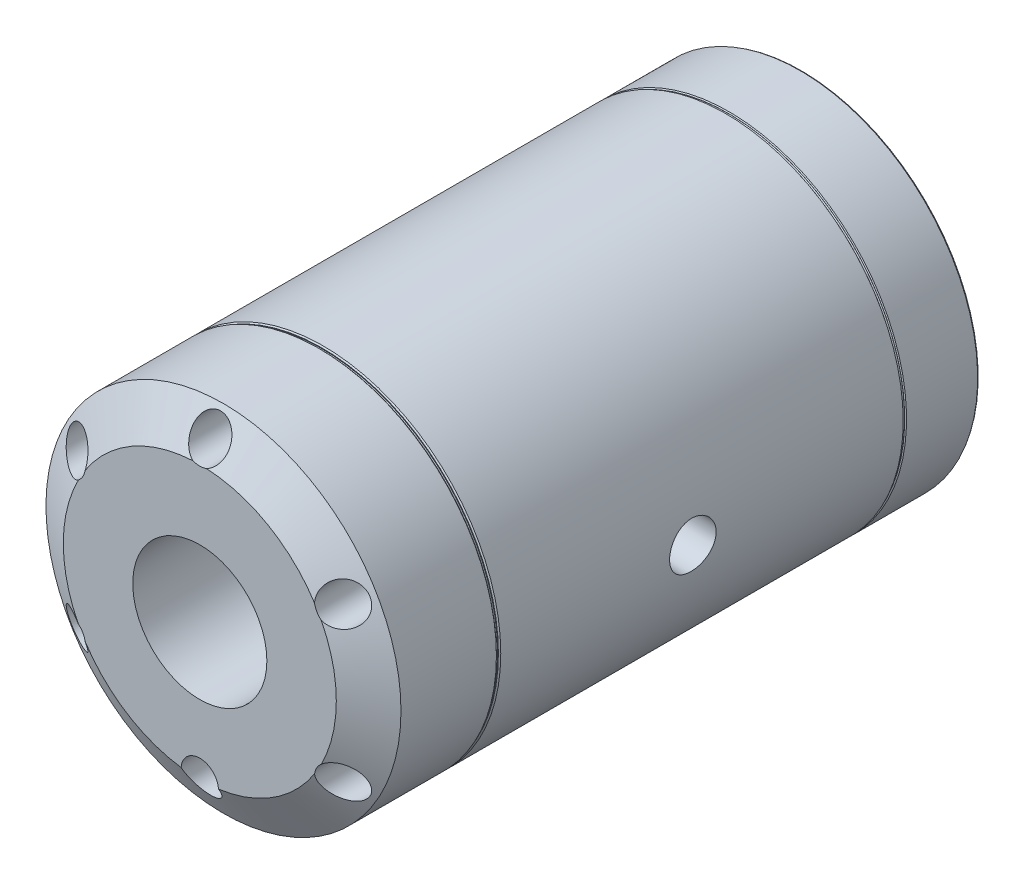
ISO-10303-21;
HEADER;
FILE_DESCRIPTION(('STEP AP214'),'2;1');
FILE_NAME('part.step','',(''),(''),'','','');
FILE_SCHEMA(('AUTOMOTIVE_DESIGN { 1 0 10303 214 1 1 1 1 }'));
ENDSEC;
DATA;
#1=APPLICATION_CONTEXT('core data for automotive mechanical design processes');
#2=APPLICATION_PROTOCOL_DEFINITION('international standard','automotive_design',2000,#1);
#3=PRODUCT_CONTEXT('',#1,'mechanical');
#4=PRODUCT('Part','Part','',(#3));
#5=PRODUCT_RELATED_PRODUCT_CATEGORY('part','',(#4));
#6=PRODUCT_DEFINITION_FORMATION('','',#4);
#7=PRODUCT_DEFINITION_CONTEXT('part definition',#1,'design');
#8=PRODUCT_DEFINITION('design','',#6,#7);
#9=PRODUCT_DEFINITION_SHAPE('','',#8);
#10=(LENGTH_UNIT() NAMED_UNIT(*) SI_UNIT(.MILLI.,.METRE.));
#11=(NAMED_UNIT(*) PLANE_ANGLE_UNIT() SI_UNIT($,.RADIAN.));
#12=(NAMED_UNIT(*) SI_UNIT($,.STERADIAN.) SOLID_ANGLE_UNIT());
#13=UNCERTAINTY_MEASURE_WITH_UNIT(LENGTH_MEASURE(1.E-05),#10,'distance_accuracy_value','');
#14=(GEOMETRIC_REPRESENTATION_CONTEXT(3) GLOBAL_UNCERTAINTY_ASSIGNED_CONTEXT((#13)) GLOBAL_UNIT_ASSIGNED_CONTEXT((#10,
#11,#12)) REPRESENTATION_CONTEXT('',''));
#15=CARTESIAN_POINT('',(0.,0.,0.));
#16=DIRECTION('',(0.,0.,1.));
#17=DIRECTION('',(1.,0.,0.));
#18=AXIS2_PLACEMENT_3D('',#15,#16,#17);
#19=CARTESIAN_POINT('',(0.,0.,102.5));
#20=DIRECTION('',(0.,0.,-1.));
#21=DIRECTION('',(-1.,0.,0.));
#22=AXIS2_PLACEMENT_3D('',#19,#20,#21);
#23=CYLINDRICAL_SURFACE('',#22,45.);
#24=CARTESIAN_POINT('',(0.,0.,0.173205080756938));
#25=DIRECTION('',(0.,0.,1.));
#26=DIRECTION('',(1.,0.,0.));
#27=AXIS2_PLACEMENT_3D('',#24,#25,#26);
#28=CIRCLE('',#27,45.);
#29=CARTESIAN_POINT('',(45.,0.,0.173205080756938));
#30=VERTEX_POINT('',#29);
#31=EDGE_CURVE('E210',#30,#30,#28,.T.);
#32=ORIENTED_EDGE('',*,*,#31,.T.);
#33=EDGE_LOOP('',(#32));
#34=FACE_BOUND('',#33,.T.);
#35=CARTESIAN_POINT('',(0.,0.,102.2));
#36=DIRECTION('',(0.,0.,1.));
#37=DIRECTION('',(1.,0.,0.));
#38=AXIS2_PLACEMENT_3D('',#35,#36,#37);
#39=CIRCLE('',#38,45.);
#40=CARTESIAN_POINT('',(45.,0.,102.2));
#41=VERTEX_POINT('',#40);
#42=EDGE_CURVE('E214',#41,#41,#39,.F.);
#43=ORIENTED_EDGE('',*,*,#42,.T.);
#44=EDGE_LOOP('',(#43));
#45=FACE_BOUND('',#44,.T.);
#46=CARTESIAN_POINT('',(-45.,0.,83.3002208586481));
#47=CARTESIAN_POINT('',(-45.0000006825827,-0.164982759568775,83.2929743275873));
#48=CARTESIAN_POINT('',(-44.999090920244,-0.329632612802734,83.2787963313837));
#49=CARTESIAN_POINT('',(-44.9954987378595,-0.657196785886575,83.2366846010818));
#50=CARTESIAN_POINT('',(-44.9928159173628,-0.820110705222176,83.2087477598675));
#51=CARTESIAN_POINT('',(-44.9857692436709,-1.14310413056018,83.1392984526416));
#52=CARTESIAN_POINT('',(-44.9814041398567,-1.30318143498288,83.0977758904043));
#53=CARTESIAN_POINT('',(-44.9711337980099,-1.61930355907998,83.0014514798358));
#54=CARTESIAN_POINT('',(-44.9652279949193,-1.77534687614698,82.9466447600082));
#55=CARTESIAN_POINT('',(-44.9520691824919,-2.08207043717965,82.8242288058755));
#56=CARTESIAN_POINT('',(-44.9448176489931,-2.23275634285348,82.7566335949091));
#57=CARTESIAN_POINT('',(-44.9291814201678,-2.52794647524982,82.6090628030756));
#58=CARTESIAN_POINT('',(-44.9207963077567,-2.67244840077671,82.5290826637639));
#59=CARTESIAN_POINT('',(-44.9031514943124,-2.95413148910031,82.357377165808));
#60=CARTESIAN_POINT('',(-44.8938922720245,-3.09131659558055,82.2656582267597));
#61=CARTESIAN_POINT('',(-44.8747663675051,-3.35755354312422,82.0710501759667));
#62=CARTESIAN_POINT('',(-44.8648994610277,-3.48660234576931,81.9681569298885));
#63=CARTESIAN_POINT('',(-44.8448001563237,-3.73626377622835,81.7513872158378));
#64=CARTESIAN_POINT('',(-44.8345661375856,-3.85682953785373,81.6374569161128));
#65=CARTESIAN_POINT('',(-44.8140803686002,-4.08799139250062,81.3998143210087));
#66=CARTESIAN_POINT('',(-44.8038286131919,-4.19858377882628,81.2760984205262));
#67=CARTESIAN_POINT('',(-44.7836177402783,-4.40893944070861,81.0198235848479));
#68=CARTESIAN_POINT('',(-44.7736585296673,-4.50870618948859,80.8872675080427));
#69=CARTESIAN_POINT('',(-44.7543203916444,-4.69678077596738,80.614148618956));
#70=CARTESIAN_POINT('',(-44.744941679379,-4.78508437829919,80.4735828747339));
#71=CARTESIAN_POINT('',(-44.7270279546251,-4.94973199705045,80.1851637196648));
#72=CARTESIAN_POINT('',(-44.7184947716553,-5.02605028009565,80.0372955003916));
#73=CARTESIAN_POINT('',(-44.7025468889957,-5.16597151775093,79.7355382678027));
#74=CARTESIAN_POINT('',(-44.6951326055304,-5.22956974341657,79.5816470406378));
#75=CARTESIAN_POINT('',(-44.6816526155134,-5.34352174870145,79.2690375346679));
#76=CARTESIAN_POINT('',(-44.6755863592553,-5.39388092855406,79.1103212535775));
#77=CARTESIAN_POINT('',(-44.6649774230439,-5.4810288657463,78.7891393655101));
#78=CARTESIAN_POINT('',(-44.6604353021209,-5.5178126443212,78.6266724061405));
#79=CARTESIAN_POINT('',(-44.6493750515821,-5.60688868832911,78.1376660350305));
#80=CARTESIAN_POINT('',(-44.6453152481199,-5.63878611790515,77.8070958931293));
#81=CARTESIAN_POINT('',(-44.6443121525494,-5.64671072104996,77.1454626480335));
#82=CARTESIAN_POINT('',(-44.6473685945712,-5.62273998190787,76.8143995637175));
#83=CARTESIAN_POINT('',(-44.6601859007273,-5.52000252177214,76.1628202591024));
#84=CARTESIAN_POINT('',(-44.6699105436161,-5.44153181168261,75.8422568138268));
#85=CARTESIAN_POINT('',(-44.6948869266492,-5.23240716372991,75.2188722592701));
#86=CARTESIAN_POINT('',(-44.710138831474,-5.10175167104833,74.9160516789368));
#87=CARTESIAN_POINT('',(-44.7444665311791,-4.79135597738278,74.3352886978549));
#88=CARTESIAN_POINT('',(-44.763558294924,-4.61140961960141,74.0574574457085));
#89=CARTESIAN_POINT('',(-44.8033020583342,-4.20774717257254,73.5357754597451));
#90=CARTESIAN_POINT('',(-44.8239541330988,-3.98402897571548,73.2919263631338));
#91=CARTESIAN_POINT('',(-44.8645652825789,-3.49724673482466,72.8432969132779));
#92=CARTESIAN_POINT('',(-44.8845182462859,-3.2339091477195,72.63881267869));
#93=CARTESIAN_POINT('',(-44.9212030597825,-2.67645638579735,72.2769146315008));
#94=CARTESIAN_POINT('',(-44.937934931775,-2.38234142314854,72.1195004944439));
#95=CARTESIAN_POINT('',(-44.9661374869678,-1.77190493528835,71.8564248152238));
#96=CARTESIAN_POINT('',(-44.9776132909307,-1.45560537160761,71.7507128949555));
#97=CARTESIAN_POINT('',(-44.9938763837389,-0.809575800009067,71.5939584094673));
#98=CARTESIAN_POINT('',(-44.9986640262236,-0.479846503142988,71.5429129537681));
#99=CARTESIAN_POINT('',(-45.0008398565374,0.181003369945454,71.4972026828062));
#100=CARTESIAN_POINT('',(-44.9982838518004,0.512094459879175,71.502113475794));
#101=CARTESIAN_POINT('',(-44.9860205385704,1.16866827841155,71.5671415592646));
#102=CARTESIAN_POINT('',(-44.9763133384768,1.4941510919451,71.6272580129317));
#103=CARTESIAN_POINT('',(-44.950707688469,2.1295058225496,71.8006956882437));
#104=CARTESIAN_POINT('',(-44.9348241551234,2.43941333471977,71.9138888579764));
#105=CARTESIAN_POINT('',(-44.898474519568,3.03584458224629,72.1901536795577));
#106=CARTESIAN_POINT('',(-44.8780082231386,3.32236732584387,72.3532274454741));
#107=CARTESIAN_POINT('',(-44.8344689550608,3.86591780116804,72.7258586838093));
#108=CARTESIAN_POINT('',(-44.8113800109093,4.12274321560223,72.9357093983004));
#109=CARTESIAN_POINT('',(-44.7651486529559,4.59766460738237,73.3954275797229));
#110=CARTESIAN_POINT('',(-44.7420062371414,4.81575910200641,73.6452965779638));
#111=CARTESIAN_POINT('',(-44.6980287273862,5.2082195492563,74.1795949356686));
#112=CARTESIAN_POINT('',(-44.6772068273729,5.3823419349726,74.4642043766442));
#113=CARTESIAN_POINT('',(-44.6403047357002,5.68030369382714,75.0589261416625));
#114=CARTESIAN_POINT('',(-44.6242243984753,5.80414461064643,75.3690376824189));
#115=CARTESIAN_POINT('',(-44.5986473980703,5.99751409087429,76.0045895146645));
#116=CARTESIAN_POINT('',(-44.5891241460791,6.06726214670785,76.3299621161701));
#117=CARTESIAN_POINT('',(-44.5776312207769,6.15115581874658,76.9881026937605));
#118=CARTESIAN_POINT('',(-44.575661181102,6.16530413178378,77.3208703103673));
#119=CARTESIAN_POINT('',(-44.5785064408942,6.14464296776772,77.8166847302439));
#120=CARTESIAN_POINT('',(-44.580406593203,6.13088365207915,77.9808886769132));
#121=CARTESIAN_POINT('',(-44.5860508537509,6.08970824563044,78.3075266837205));
#122=CARTESIAN_POINT('',(-44.5897942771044,6.06229722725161,78.4699613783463));
#123=CARTESIAN_POINT('',(-44.5990258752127,5.99400237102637,78.7919729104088));
#124=CARTESIAN_POINT('',(-44.6045146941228,5.95311355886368,78.9515486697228));
#125=CARTESIAN_POINT('',(-44.6170813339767,5.85818620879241,79.2666149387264));
#126=CARTESIAN_POINT('',(-44.6241585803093,5.80415242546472,79.4221069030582));
#127=CARTESIAN_POINT('',(-44.6397188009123,5.6832404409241,79.7281740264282));
#128=CARTESIAN_POINT('',(-44.6482035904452,5.61634563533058,79.878742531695));
#129=CARTESIAN_POINT('',(-44.6663365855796,5.47026399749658,80.1736518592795));
#130=CARTESIAN_POINT('',(-44.6759843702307,5.39108160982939,80.317994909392));
#131=CARTESIAN_POINT('',(-44.696187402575,5.22093576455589,80.5995683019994));
#132=CARTESIAN_POINT('',(-44.7067429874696,5.12996792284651,80.7367959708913));
#133=CARTESIAN_POINT('',(-44.7284696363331,4.93694535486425,81.0030905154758));
#134=CARTESIAN_POINT('',(-44.7396404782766,4.8348946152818,81.1321602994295));
#135=CARTESIAN_POINT('',(-44.7623924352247,4.61952789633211,81.3823048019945));
#136=CARTESIAN_POINT('',(-44.7739761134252,4.50612849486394,81.5033074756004));
#137=CARTESIAN_POINT('',(-44.7971508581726,4.26958874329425,81.7352929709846));
#138=CARTESIAN_POINT('',(-44.8087419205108,4.14645194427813,81.8462794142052));
#139=CARTESIAN_POINT('',(-44.8316311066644,3.89117976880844,82.0575691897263));
#140=CARTESIAN_POINT('',(-44.8429290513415,3.75903906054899,82.1578661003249));
#141=CARTESIAN_POINT('',(-44.8649184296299,3.48679424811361,82.3469570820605));
#142=CARTESIAN_POINT('',(-44.8756100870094,3.34669312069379,82.4357554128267));
#143=CARTESIAN_POINT('',(-44.8961411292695,3.05898278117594,82.6015333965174));
#144=CARTESIAN_POINT('',(-44.9059775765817,2.9113502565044,82.6784729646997));
#145=CARTESIAN_POINT('',(-44.9244934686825,2.61010532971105,82.81959267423));
#146=CARTESIAN_POINT('',(-44.9331733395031,2.45649515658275,82.8837775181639));
#147=CARTESIAN_POINT('',(-44.9491457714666,2.14445163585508,82.9989054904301));
#148=CARTESIAN_POINT('',(-44.9564394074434,1.98602213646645,83.0498588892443));
#149=CARTESIAN_POINT('',(-44.9694578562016,1.66541611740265,83.1381975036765));
#150=CARTESIAN_POINT('',(-44.9751830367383,1.50324048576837,83.1755859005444));
#151=CARTESIAN_POINT('',(-44.9866173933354,1.11928964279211,83.2471407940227));
#152=CARTESIAN_POINT('',(-44.9916274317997,0.896416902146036,83.2756565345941));
#153=CARTESIAN_POINT('',(-44.9983182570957,0.448824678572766,83.3071181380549));
#154=CARTESIAN_POINT('',(-44.9999990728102,0.22410521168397,83.3100642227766));
#155=CARTESIAN_POINT('',(-45.,0.,83.3002208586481));
#156=B_SPLINE_CURVE_WITH_KNOTS('',3,(#46,#47,#48,#49,#50,#51,#52,#53,#54,#55,#56,#57,#58,#59,
#60,#61,#62,#63,#64,#65,#66,#67,#68,#69,#70,#71,#72,#73,#74,#75,#76,#77,#78,#79,#80,#81,#82,#83,
#84,#85,#86,#87,#88,#89,#90,#91,#92,#93,#94,#95,#96,#97,#98,#99,#100,#101,#102,#103,#104,#105,
#106,#107,#108,#109,#110,#111,#112,#113,#114,#115,#116,#117,#118,#119,#120,#121,#122,#123,#124,
#125,#126,#127,#128,#129,#130,#131,#132,#133,#134,#135,#136,#137,#138,#139,#140,#141,#142,#143,
#144,#145,#146,#147,#148,#149,#150,#151,#152,#153,#154,#155),.UNSPECIFIED.,.T.,.F.,(4,2,2,2,2,2,
2,2,2,2,2,2,2,2,2,2,2,2,2,2,2,2,2,2,2,2,2,2,2,2,2,2,2,2,2,2,2,2,2,2,2,2,2,2,2,2,2,2,2,2,2,2,2,2,
4),(0.,0.495228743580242,0.990569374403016,1.48627895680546,1.98217059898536,2.47752158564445,
2.97305532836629,3.46831922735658,3.96376699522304,4.46176617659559,4.95994968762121,
5.45797288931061,5.95617957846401,6.45544174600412,6.95488918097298,7.45413257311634,
7.95355888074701,8.94476358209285,9.93593125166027,10.9217571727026,11.9076124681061,
12.8976557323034,13.887746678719,14.8850170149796,15.8822804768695,16.8785702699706,
17.8748073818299,18.8634937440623,19.852165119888,20.8384634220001,21.8248035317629,
22.8175101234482,23.8102547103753,24.8083832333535,25.8064811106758,26.8005075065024,
27.7944856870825,28.2883770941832,28.782085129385,29.2759755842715,29.7696876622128,
30.2640414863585,30.7582169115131,31.2525766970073,31.746759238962,32.2448865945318,
32.7428331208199,33.2410771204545,33.7391360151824,34.2388431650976,34.7383657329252,
35.2374993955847,35.7365159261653,36.4092183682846,37.0819149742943),.UNSPECIFIED.);
#157=CARTESIAN_POINT('',(-45.,0.,83.3002208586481));
#158=VERTEX_POINT('',#157);
#159=EDGE_CURVE('E156',#158,#158,#156,.T.);
#160=ORIENTED_EDGE('',*,*,#159,.T.);
#161=EDGE_LOOP('',(#160));
#162=FACE_BOUND('',#161,.T.);
#163=CARTESIAN_POINT('',(44.7032046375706,5.15979603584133,53.4874954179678));
#164=CARTESIAN_POINT('',(44.7032039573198,5.15979802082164,53.3225008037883));
#165=CARTESIAN_POINT('',(44.7040069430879,5.1528581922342,53.1575348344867));
#166=CARTESIAN_POINT('',(44.7071919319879,5.12515308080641,52.8287312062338));
#167=CARTESIAN_POINT('',(44.7095742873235,5.10438471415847,52.6648938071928));
#168=CARTESIAN_POINT('',(44.7158452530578,5.04915358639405,52.3394541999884));
#169=CARTESIAN_POINT('',(44.7197349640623,5.01468081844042,52.177853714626));
#170=CARTESIAN_POINT('',(44.7288976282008,4.93228491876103,51.8580953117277));
#171=CARTESIAN_POINT('',(44.7341710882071,4.884356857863,51.6999386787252));
#172=CARTESIAN_POINT('',(44.7459258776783,4.77546958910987,51.3884153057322));
#173=CARTESIAN_POINT('',(44.7524059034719,4.71452443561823,51.2350436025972));
#174=CARTESIAN_POINT('',(44.7663739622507,4.57999283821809,50.9339287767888));
#175=CARTESIAN_POINT('',(44.7738623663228,4.50640173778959,50.7861877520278));
#176=CARTESIAN_POINT('',(44.7896029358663,4.34716720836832,50.4974981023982));
#177=CARTESIAN_POINT('',(44.7978546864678,4.26153031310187,50.3565458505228));
#178=CARTESIAN_POINT('',(44.8148662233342,4.07874852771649,50.0822690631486));
#179=CARTESIAN_POINT('',(44.8236261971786,3.9815993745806,49.9489473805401));
#180=CARTESIAN_POINT('',(44.8414174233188,3.77597452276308,49.6902429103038));
#181=CARTESIAN_POINT('',(44.8504498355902,3.66744334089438,49.5649042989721));
#182=CARTESIAN_POINT('',(44.8684531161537,3.44019010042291,49.3237414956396));
#183=CARTESIAN_POINT('',(44.8774239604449,3.32146428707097,49.207920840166));
#184=CARTESIAN_POINT('',(44.8950036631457,3.07472509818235,48.9866875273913));
#185=CARTESIAN_POINT('',(44.9036126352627,2.94671467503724,48.8812715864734));
#186=CARTESIAN_POINT('',(44.9201878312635,2.68221681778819,48.6815084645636));
#187=CARTESIAN_POINT('',(44.9281538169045,2.54572627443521,48.5871653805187));
#188=CARTESIAN_POINT('',(44.9431921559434,2.26480105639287,48.4099706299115));
#189=CARTESIAN_POINT('',(44.9502614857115,2.12034174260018,48.3271577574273));
#190=CARTESIAN_POINT('',(44.9632268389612,1.82486006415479,48.1739620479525));
#191=CARTESIAN_POINT('',(44.9691224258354,1.67383528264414,48.1035838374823));
#192=CARTESIAN_POINT('',(44.9795130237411,1.36639181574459,47.9758360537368));
#193=CARTESIAN_POINT('',(44.9840085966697,1.20997532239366,47.9184612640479));
#194=CARTESIAN_POINT('',(44.9914229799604,0.892811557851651,47.8170932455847));
#195=CARTESIAN_POINT('',(44.9943412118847,0.732062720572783,47.7731049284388));
#196=CARTESIAN_POINT('',(45.0004725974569,0.247027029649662,47.662248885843));
#197=CARTESIAN_POINT('',(45.0011376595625,-0.0821785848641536,47.6156082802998));
#198=CARTESIAN_POINT('',(44.9950748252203,-0.743495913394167,47.5781945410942));
#199=CARTESIAN_POINT('',(44.9883472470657,-1.07560750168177,47.5874190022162));
#200=CARTESIAN_POINT('',(44.9678688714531,-1.73138131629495,47.6611474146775));
#201=CARTESIAN_POINT('',(44.95416143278,-2.05508289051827,47.725311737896));
#202=CARTESIAN_POINT('',(44.9208236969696,-2.6869681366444,47.9065867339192));
#203=CARTESIAN_POINT('',(44.9011932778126,-2.99515148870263,48.0236984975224));
#204=CARTESIAN_POINT('',(44.8576933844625,-3.58833288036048,48.3078969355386));
#205=CARTESIAN_POINT('',(44.8338116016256,-3.87325999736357,48.4751297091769));
#206=CARTESIAN_POINT('',(44.7840968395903,-4.41109191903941,48.8547180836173));
#207=CARTESIAN_POINT('',(44.7582637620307,-4.663995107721,49.0670759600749));
#208=CARTESIAN_POINT('',(44.7069598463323,-5.13262520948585,49.5327865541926));
#209=CARTESIAN_POINT('',(44.6814931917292,-5.34805833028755,49.7864354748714));
#210=CARTESIAN_POINT('',(44.6336887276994,-5.73338014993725,50.3265131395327));
#211=CARTESIAN_POINT('',(44.6113509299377,-5.9032686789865,50.6129420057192));
#212=CARTESIAN_POINT('',(44.5720940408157,-6.19272831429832,51.2107207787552));
#213=CARTESIAN_POINT('',(44.5551776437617,-6.31227441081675,51.5220829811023));
#214=CARTESIAN_POINT('',(44.5285583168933,-6.49740893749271,52.1607471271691));
#215=CARTESIAN_POINT('',(44.5188550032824,-6.56300023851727,52.4880482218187));
#216=CARTESIAN_POINT('',(44.5077365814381,-6.63798421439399,53.1466998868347));
#217=CARTESIAN_POINT('',(44.5062605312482,-6.64779012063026,53.4780024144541));
#218=CARTESIAN_POINT('',(44.5115886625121,-6.61201851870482,54.1375295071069));
#219=CARTESIAN_POINT('',(44.5183926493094,-6.56644231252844,54.4657541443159));
#220=CARTESIAN_POINT('',(44.539522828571,-6.42154026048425,55.1085576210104));
#221=CARTESIAN_POINT('',(44.5538208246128,-6.32241584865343,55.4231828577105));
#222=CARTESIAN_POINT('',(44.5884431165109,-6.07342133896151,56.0313106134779));
#223=CARTESIAN_POINT('',(44.6087676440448,-5.92354929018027,56.3248123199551));
#224=CARTESIAN_POINT('',(44.6535086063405,-5.57627846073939,56.884231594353));
#225=CARTESIAN_POINT('',(44.6779480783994,-5.37860920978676,57.149979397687));
#226=CARTESIAN_POINT('',(44.7283778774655,-4.94170469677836,57.6446120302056));
#227=CARTESIAN_POINT('',(44.7543682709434,-4.70246765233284,57.8734952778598));
#228=CARTESIAN_POINT('',(44.8055031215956,-4.18738258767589,58.2893644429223));
#229=CARTESIAN_POINT('',(44.8306412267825,-3.91131367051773,58.4760776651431));
#230=CARTESIAN_POINT('',(44.8774563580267,-3.33142253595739,58.8004152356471));
#231=CARTESIAN_POINT('',(44.8991334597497,-3.02760092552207,58.938040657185));
#232=CARTESIAN_POINT('',(44.9369507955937,-2.40176058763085,59.1598549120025));
#233=CARTESIAN_POINT('',(44.9531070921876,-2.07979788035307,59.2441993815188));
#234=CARTESIAN_POINT('',(44.978592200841,-1.42583505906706,59.3575410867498));
#235=CARTESIAN_POINT('',(44.987921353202,-1.09383544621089,59.3865410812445));
#236=CARTESIAN_POINT('',(44.9963420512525,-0.597213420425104,59.3879361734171));
#237=CARTESIAN_POINT('',(44.9982229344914,-0.432434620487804,59.3814721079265));
#238=CARTESIAN_POINT('',(45.0001783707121,-0.104000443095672,59.3547877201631));
#239=CARTESIAN_POINT('',(45.0002535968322,0.0596553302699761,59.3345725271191));
#240=CARTESIAN_POINT('',(44.998649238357,0.384741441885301,59.280520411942));
#241=CARTESIAN_POINT('',(44.9969690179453,0.546170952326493,59.24667855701));
#242=CARTESIAN_POINT('',(44.9919582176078,0.865556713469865,59.1656419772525));
#243=CARTESIAN_POINT('',(44.9886282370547,1.02351420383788,59.1184521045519));
#244=CARTESIAN_POINT('',(44.9804660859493,1.33488921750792,59.0110634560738));
#245=CARTESIAN_POINT('',(44.9756340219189,1.48830706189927,58.9508656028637));
#246=CARTESIAN_POINT('',(44.964657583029,1.78948884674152,58.8179192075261));
#247=CARTESIAN_POINT('',(44.95851368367,1.93725481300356,58.7451752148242));
#248=CARTESIAN_POINT('',(44.9451318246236,2.22622022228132,58.5876113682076));
#249=CARTESIAN_POINT('',(44.9378934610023,2.36741721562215,58.502787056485));
#250=CARTESIAN_POINT('',(44.9225767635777,2.64216270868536,58.3217134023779));
#251=CARTESIAN_POINT('',(44.9144987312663,2.77571392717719,58.2254681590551));
#252=CARTESIAN_POINT('',(44.8977070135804,3.03528428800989,58.0214282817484));
#253=CARTESIAN_POINT('',(44.8889889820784,3.16123881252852,57.9135517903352));
#254=CARTESIAN_POINT('',(44.8712644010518,3.40358506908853,57.6876514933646));
#255=CARTESIAN_POINT('',(44.8622579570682,3.51998024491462,57.5696313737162));
#256=CARTESIAN_POINT('',(44.8442423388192,3.74251276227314,57.3241562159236));
#257=CARTESIAN_POINT('',(44.8352331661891,3.84864386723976,57.1966955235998));
#258=CARTESIAN_POINT('',(44.8175127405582,4.04978327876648,56.9333362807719));
#259=CARTESIAN_POINT('',(44.808801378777,4.14479567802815,56.7974408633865));
#260=CARTESIAN_POINT('',(44.7919145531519,4.32348069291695,56.5174656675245));
#261=CARTESIAN_POINT('',(44.7837417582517,4.40709874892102,56.3733508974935));
#262=CARTESIAN_POINT('',(44.7682443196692,4.56183594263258,56.078585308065));
#263=CARTESIAN_POINT('',(44.7609193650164,4.63295966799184,55.9279369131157));
#264=CARTESIAN_POINT('',(44.7473567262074,4.76217264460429,55.6212353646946));
#265=CARTESIAN_POINT('',(44.7411182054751,4.82027193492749,55.4651864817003));
#266=CARTESIAN_POINT('',(44.7299246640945,4.92305849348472,55.1487427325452));
#267=CARTESIAN_POINT('',(44.7249693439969,4.96774889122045,54.9883488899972));
#268=CARTESIAN_POINT('',(44.7150103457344,5.0567330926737,54.6071747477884));
#269=CARTESIAN_POINT('',(44.7106046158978,5.0953408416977,54.3850269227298));
#270=CARTESIAN_POINT('',(44.7047022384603,5.14687084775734,53.9377334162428));
#271=CARTESIAN_POINT('',(44.7032055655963,5.1597933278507,53.7125877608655));
#272=CARTESIAN_POINT('',(44.7032046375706,5.15979603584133,53.4874954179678));
#273=B_SPLINE_CURVE_WITH_KNOTS('',3,(#163,#164,#165,#166,#167,#168,#169,#170,#171,#172,#173,
#174,#175,#176,#177,#178,#179,#180,#181,#182,#183,#184,#185,#186,#187,#188,#189,#190,#191,#192,
#193,#194,#195,#196,#197,#198,#199,#200,#201,#202,#203,#204,#205,#206,#207,#208,#209,#210,#211,
#212,#213,#214,#215,#216,#217,#218,#219,#220,#221,#222,#223,#224,#225,#226,#227,#228,#229,#230,
#231,#232,#233,#234,#235,#236,#237,#238,#239,#240,#241,#242,#243,#244,#245,#246,#247,#248,#249,
#250,#251,#252,#253,#254,#255,#256,#257,#258,#259,#260,#261,#262,#263,#264,#265,#266,#267,#268,
#269,#270,#271,#272),.UNSPECIFIED.,.T.,.F.,(4,2,2,2,2,2,2,2,2,2,2,2,2,2,2,2,2,2,2,2,2,2,2,2,2,2,
2,2,2,2,2,2,2,2,2,2,2,2,2,2,2,2,2,2,2,2,2,2,2,2,2,2,2,2,4),(0.,0.494786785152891,
0.989683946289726,1.48494314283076,1.98038400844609,2.47529263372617,2.97038388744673,
3.46520762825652,3.96021517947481,4.45775898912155,4.95548683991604,5.45305710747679,
5.95081089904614,6.45020090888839,6.94977633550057,7.44915099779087,7.94870866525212,
8.94099403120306,9.93323667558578,10.9193893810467,11.9055624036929,12.894638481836,
13.8837644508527,14.8803268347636,15.8768929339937,16.8739535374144,17.8709610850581,
18.8605735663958,19.8501627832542,20.8360550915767,21.8219853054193,22.8136308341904,
23.8053188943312,24.803247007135,25.8011532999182,26.7961310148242,27.7910591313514,
28.2853267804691,28.7794101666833,29.2736725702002,29.7677555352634,30.2618034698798,
30.7556726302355,31.2497245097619,31.743599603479,32.2412105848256,32.7386415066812,
33.2363727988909,33.7339203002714,34.233772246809,34.7334402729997,35.2327218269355,
35.7318867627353,36.4069008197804,37.0819090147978),.UNSPECIFIED.);
#274=CARTESIAN_POINT('',(44.7032046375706,5.15979603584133,53.4874954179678));
#275=VERTEX_POINT('',#274);
#276=EDGE_CURVE('E162',#275,#275,#273,.T.);
#277=ORIENTED_EDGE('',*,*,#276,.T.);
#278=EDGE_LOOP('',(#277));
#279=FACE_BOUND('',#278,.T.);
#280=ADVANCED_FACE('F16',(#34,#45,#162,#279),#23,.T.);
#281=CARTESIAN_POINT('',(0.,0.,102.5));
#282=DIRECTION('',(0.,0.,1.));
#283=DIRECTION('',(1.,0.,0.));
#284=AXIS2_PLACEMENT_3D('',#281,#282,#283);
#285=PLANE('',#284);
#286=CARTESIAN_POINT('',(0.,0.,102.5));
#287=DIRECTION('',(0.,0.,1.));
#288=DIRECTION('',(1.,0.,0.));
#289=AXIS2_PLACEMENT_3D('',#286,#287,#288);
#290=CIRCLE('',#289,44.7);
#291=CARTESIAN_POINT('',(44.7,0.,102.5));
#292=VERTEX_POINT('',#291);
#293=EDGE_CURVE('E155',#292,#292,#290,.T.);
#294=ORIENTED_EDGE('',*,*,#293,.T.);
#295=EDGE_LOOP('',(#294));
#296=FACE_BOUND('',#295,.T.);
#297=CARTESIAN_POINT('',(0.,0.,102.5));
#298=DIRECTION('',(0.,0.,1.));
#299=DIRECTION('',(1.,0.,0.));
#300=AXIS2_PLACEMENT_3D('',#297,#298,#299);
#301=CIRCLE('',#300,44.5);
#302=CARTESIAN_POINT('',(44.5,0.,102.5));
#303=VERTEX_POINT('',#302);
#304=EDGE_CURVE('E152',#303,#303,#301,.T.);
#305=ORIENTED_EDGE('',*,*,#304,.F.);
#306=EDGE_LOOP('',(#305));
#307=FACE_BOUND('',#306,.T.);
#308=ADVANCED_FACE('F191',(#296,#307),#285,.T.);
#309=CARTESIAN_POINT('',(0.,0.,0.));
#310=DIRECTION('',(0.,0.,1.));
#311=DIRECTION('',(1.,0.,0.));
#312=AXIS2_PLACEMENT_3D('',#309,#310,#311);
#313=PLANE('',#312);
#314=CARTESIAN_POINT('',(0.,0.,0.));
#315=DIRECTION('',(0.,0.,1.));
#316=DIRECTION('',(1.,0.,0.));
#317=AXIS2_PLACEMENT_3D('',#314,#315,#316);
#318=CIRCLE('',#317,44.7);
#319=CARTESIAN_POINT('',(44.7,0.,0.));
#320=VERTEX_POINT('',#319);
#321=EDGE_CURVE('E414',#320,#320,#318,.F.);
#322=ORIENTED_EDGE('',*,*,#321,.T.);
#323=EDGE_LOOP('',(#322));
#324=FACE_BOUND('',#323,.T.);
#325=CARTESIAN_POINT('',(0.,0.,0.));
#326=DIRECTION('',(0.,0.,-1.));
#327=DIRECTION('',(-1.,0.,0.));
#328=AXIS2_PLACEMENT_3D('',#325,#326,#327);
#329=CIRCLE('',#328,44.5);
#330=CARTESIAN_POINT('',(-44.5,0.,0.));
#331=VERTEX_POINT('',#330);
#332=EDGE_CURVE('E110',#331,#331,#329,.T.);
#333=ORIENTED_EDGE('',*,*,#332,.F.);
#334=EDGE_LOOP('',(#333));
#335=FACE_BOUND('',#334,.T.);
#336=ADVANCED_FACE('F184',(#324,#335),#313,.F.);
#337=CARTESIAN_POINT('',(44.9938188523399,-0.745831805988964,53.4874954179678));
#338=DIRECTION('',(0.999862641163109,-0.0165740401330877,0.));
#339=DIRECTION('',(0.0165740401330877,0.999862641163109,0.));
#340=AXIS2_PLACEMENT_3D('',#337,#338,#339);
#341=CYLINDRICAL_SURFACE('',#340,5.9);
#342=CARTESIAN_POINT('',(25.9864300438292,-0.430759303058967,53.4874954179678));
#343=DIRECTION('',(0.999862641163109,-0.0165740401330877,0.));
#344=DIRECTION('',(0.0165740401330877,0.999862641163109,0.));
#345=AXIS2_PLACEMENT_3D('',#342,#343,#344);
#346=CIRCLE('',#345,5.9);
#347=CARTESIAN_POINT('',(26.0842168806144,5.46843027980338,53.4874954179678));
#348=VERTEX_POINT('',#347);
#349=EDGE_CURVE('E159',#348,#348,#346,.T.);
#350=ORIENTED_EDGE('',*,*,#349,.F.);
#351=EDGE_LOOP('',(#350));
#352=FACE_BOUND('',#351,.T.);
#353=ORIENTED_EDGE('',*,*,#276,.F.);
#354=EDGE_LOOP('',(#353));
#355=FACE_BOUND('',#354,.T.);
#356=ADVANCED_FACE('F178',(#352,#355),#341,.F.);
#357=CARTESIAN_POINT('',(25.9864300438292,-0.430759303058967,53.4874954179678));
#358=DIRECTION('',(0.999862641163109,-0.0165740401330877,0.));
#359=DIRECTION('',(0.0165740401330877,0.999862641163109,0.));
#360=AXIS2_PLACEMENT_3D('',#357,#358,#359);
#361=CONICAL_SURFACE('',#360,5.9,1.02974425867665);
#362=CARTESIAN_POINT('',(22.4418393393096,-0.372003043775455,53.4874954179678));
#363=VERTEX_POINT('',#362);
#364=VERTEX_LOOP('',#363);
#365=FACE_BOUND('',#364,.T.);
#366=ORIENTED_EDGE('',*,*,#349,.T.);
#367=EDGE_LOOP('',(#366));
#368=FACE_BOUND('',#367,.T.);
#369=ADVANCED_FACE('F183',(#365,#368),#361,.F.);
#370=CARTESIAN_POINT('',(-44.9992548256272,0.258969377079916,77.405907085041));
#371=DIRECTION('',(-0.999983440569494,0.00575487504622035,0.));
#372=DIRECTION('',(-0.00575487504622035,-0.999983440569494,0.));
#373=AXIS2_PLACEMENT_3D('',#370,#371,#372);
#374=CYLINDRICAL_SURFACE('',#373,5.9);
#375=CARTESIAN_POINT('',(-25.9895696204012,0.149569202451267,77.405907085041));
#376=DIRECTION('',(-0.999983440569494,0.00575487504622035,0.));
#377=DIRECTION('',(-0.00575487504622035,-0.999983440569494,0.));
#378=AXIS2_PLACEMENT_3D('',#375,#376,#377);
#379=CIRCLE('',#378,5.9);
#380=CARTESIAN_POINT('',(-26.0235233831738,-5.75033309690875,77.405907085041));
#381=VERTEX_POINT('',#380);
#382=EDGE_CURVE('E151',#381,#381,#379,.T.);
#383=ORIENTED_EDGE('',*,*,#382,.F.);
#384=EDGE_LOOP('',(#383));
#385=FACE_BOUND('',#384,.T.);
#386=ORIENTED_EDGE('',*,*,#159,.F.);
#387=EDGE_LOOP('',(#386));
#388=FACE_BOUND('',#387,.T.);
#389=ADVANCED_FACE('F189',(#385,#388),#374,.F.);
#390=CARTESIAN_POINT('',(-25.9895696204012,0.149569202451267,77.405907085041));
#391=DIRECTION('',(-0.999983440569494,0.00575487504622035,0.));
#392=DIRECTION('',(-0.00575487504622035,-0.999983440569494,0.));
#393=AXIS2_PLACEMENT_3D('',#390,#391,#392);
#394=CONICAL_SURFACE('',#393,5.9,1.02974425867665);
#395=CARTESIAN_POINT('',(-22.4445506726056,0.129167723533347,77.405907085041));
#396=VERTEX_POINT('',#395);
#397=VERTEX_LOOP('',#396);
#398=FACE_BOUND('',#397,.T.);
#399=ORIENTED_EDGE('',*,*,#382,.T.);
#400=EDGE_LOOP('',(#399));
#401=FACE_BOUND('',#400,.T.);
#402=ADVANCED_FACE('F186',(#398,#401),#394,.F.);
#403=CARTESIAN_POINT('',(0.,0.,103.));
#404=DIRECTION('',(0.,0.,-1.));
#405=DIRECTION('',(-1.,0.,0.));
#406=AXIS2_PLACEMENT_3D('',#403,#404,#405);
#407=CYLINDRICAL_SURFACE('',#406,44.5);
#408=CARTESIAN_POINT('',(0.,0.,103.));
#409=DIRECTION('',(0.,0.,1.));
#410=DIRECTION('',(1.,0.,0.));
#411=AXIS2_PLACEMENT_3D('',#408,#409,#410);
#412=CIRCLE('',#411,44.5);
#413=CARTESIAN_POINT('',(44.5,0.,103.));
#414=VERTEX_POINT('',#413);
#415=EDGE_CURVE('E146',#414,#414,#412,.T.);
#416=ORIENTED_EDGE('',*,*,#415,.F.);
#417=EDGE_LOOP('',(#416));
#418=FACE_BOUND('',#417,.T.);
#419=ORIENTED_EDGE('',*,*,#304,.T.);
#420=EDGE_LOOP('',(#419));
#421=FACE_BOUND('',#420,.T.);
#422=ADVANCED_FACE('F227',(#418,#421),#407,.T.);
#423=CARTESIAN_POINT('',(0.,0.,133.5));
#424=DIRECTION('',(0.,0.,-1.));
#425=DIRECTION('',(-1.,0.,0.));
#426=AXIS2_PLACEMENT_3D('',#423,#424,#425);
#427=CYLINDRICAL_SURFACE('',#426,45.);
#428=CARTESIAN_POINT('',(0.,0.,127.5));
#429=DIRECTION('',(0.,0.,1.));
#430=DIRECTION('',(1.,0.,0.));
#431=AXIS2_PLACEMENT_3D('',#428,#429,#430);
#432=CIRCLE('',#431,45.);
#433=CARTESIAN_POINT('',(45.,0.,127.5));
#434=VERTEX_POINT('',#433);
#435=EDGE_CURVE('E354',#434,#434,#432,.F.);
#436=ORIENTED_EDGE('',*,*,#435,.T.);
#437=EDGE_LOOP('',(#436));
#438=FACE_BOUND('',#437,.T.);
#439=CARTESIAN_POINT('',(0.,0.,103.3));
#440=DIRECTION('',(0.,0.,1.));
#441=DIRECTION('',(1.,0.,0.));
#442=AXIS2_PLACEMENT_3D('',#439,#440,#441);
#443=CIRCLE('',#442,45.);
#444=CARTESIAN_POINT('',(45.,0.,103.3));
#445=VERTEX_POINT('',#444);
#446=EDGE_CURVE('E753',#445,#445,#443,.T.);
#447=ORIENTED_EDGE('',*,*,#446,.T.);
#448=EDGE_LOOP('',(#447));
#449=FACE_BOUND('',#448,.T.);
#450=ADVANCED_FACE('F234',(#438,#449),#427,.T.);
#451=CARTESIAN_POINT('',(0.,0.,133.5));
#452=DIRECTION('',(0.,0.,1.));
#453=DIRECTION('',(1.,0.,0.));
#454=AXIS2_PLACEMENT_3D('',#451,#452,#453);
#455=PLANE('',#454);
#456=CARTESIAN_POINT('',(0.,39.,133.5));
#457=DIRECTION('',(0.,0.,1.));
#458=DIRECTION('',(1.,0.,0.));
#459=AXIS2_PLACEMENT_3D('',#456,#457,#458);
#460=CIRCLE('',#459,4.75);
#461=CARTESIAN_POINT('',(-1.70296939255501,34.5657700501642,133.5));
#462=VERTEX_POINT('',#461);
#463=CARTESIAN_POINT('',(1.70296939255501,34.5657700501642,133.5));
#464=VERTEX_POINT('',#463);
#465=EDGE_CURVE('E119',#462,#464,#460,.T.);
#466=ORIENTED_EDGE('',*,*,#465,.F.);
#467=CARTESIAN_POINT('',(0.,0.,133.5));
#468=DIRECTION('',(0.,0.,1.));
#469=DIRECTION('',(1.,0.,0.));
#470=AXIS2_PLACEMENT_3D('',#467,#468,#469);
#471=CIRCLE('',#470,34.6076951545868);
#472=CARTESIAN_POINT('',(-29.083350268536,18.757699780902,133.5));
#473=VERTEX_POINT('',#472);
#474=EDGE_CURVE('E358',#462,#473,#471,.T.);
#475=ORIENTED_EDGE('',*,*,#474,.T.);
#476=CARTESIAN_POINT('',(-33.7749907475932,19.5,133.5));
#477=DIRECTION('',(0.,0.,1.));
#478=DIRECTION('',(1.,0.,0.));
#479=AXIS2_PLACEMENT_3D('',#476,#477,#478);
#480=CIRCLE('',#479,4.75);
#481=CARTESIAN_POINT('',(-30.786319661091,15.808070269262,133.5));
#482=VERTEX_POINT('',#481);
#483=EDGE_CURVE('E128',#482,#473,#480,.T.);
#484=ORIENTED_EDGE('',*,*,#483,.F.);
#485=CARTESIAN_POINT('',(-30.7863196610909,-15.8080702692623,133.5));
#486=VERTEX_POINT('',#485);
#487=EDGE_CURVE('E348',#482,#486,#471,.T.);
#488=ORIENTED_EDGE('',*,*,#487,.T.);
#489=CARTESIAN_POINT('',(-33.774990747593,-19.5,133.5));
#490=DIRECTION('',(0.,0.,1.));
#491=DIRECTION('',(1.,0.,0.));
#492=AXIS2_PLACEMENT_3D('',#489,#490,#491);
#493=CIRCLE('',#492,4.75);
#494=CARTESIAN_POINT('',(-29.0833502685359,-18.7576997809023,133.5));
#495=VERTEX_POINT('',#494);
#496=EDGE_CURVE('E133',#495,#486,#493,.T.);
#497=ORIENTED_EDGE('',*,*,#496,.F.);
#498=CARTESIAN_POINT('',(-4.73880155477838,-34.2817199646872,133.5));
#499=VERTEX_POINT('',#498);
#500=EDGE_CURVE('E342',#495,#499,#471,.T.);
#501=ORIENTED_EDGE('',*,*,#500,.T.);
#502=CARTESIAN_POINT('',(0.,-34.6076951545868,133.5));
#503=DIRECTION('',(0.,0.,1.));
#504=DIRECTION('',(1.,0.,0.));
#505=AXIS2_PLACEMENT_3D('',#502,#503,#504);
#506=CIRCLE('',#505,4.75);
#507=CARTESIAN_POINT('',(4.73880155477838,-34.2817199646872,133.5));
#508=VERTEX_POINT('',#507);
#509=EDGE_CURVE('E37',#508,#499,#506,.T.);
#510=ORIENTED_EDGE('',*,*,#509,.F.);
#511=CARTESIAN_POINT('',(29.0833502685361,-18.7576997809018,133.5));
#512=VERTEX_POINT('',#511);
#513=EDGE_CURVE('E340',#508,#512,#471,.T.);
#514=ORIENTED_EDGE('',*,*,#513,.T.);
#515=CARTESIAN_POINT('',(33.7749907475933,-19.4999999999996,133.5));
#516=DIRECTION('',(0.,0.,1.));
#517=DIRECTION('',(1.,0.,0.));
#518=AXIS2_PLACEMENT_3D('',#515,#516,#517);
#519=CIRCLE('',#518,4.75);
#520=CARTESIAN_POINT('',(30.7863196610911,-15.8080702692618,133.5));
#521=VERTEX_POINT('',#520);
#522=EDGE_CURVE('E30',#521,#512,#519,.T.);
#523=ORIENTED_EDGE('',*,*,#522,.F.);
#524=CARTESIAN_POINT('',(30.7863196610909,15.8080702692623,133.5));
#525=VERTEX_POINT('',#524);
#526=EDGE_CURVE('E346',#521,#525,#471,.T.);
#527=ORIENTED_EDGE('',*,*,#526,.T.);
#528=CARTESIAN_POINT('',(33.774990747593,19.5,133.5));
#529=DIRECTION('',(0.,0.,1.));
#530=DIRECTION('',(1.,0.,0.));
#531=AXIS2_PLACEMENT_3D('',#528,#529,#530);
#532=CIRCLE('',#531,4.75);
#533=CARTESIAN_POINT('',(29.0833502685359,18.7576997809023,133.5));
#534=VERTEX_POINT('',#533);
#535=EDGE_CURVE('E109',#534,#525,#532,.T.);
#536=ORIENTED_EDGE('',*,*,#535,.F.);
#537=EDGE_CURVE('E351',#534,#464,#471,.T.);
#538=ORIENTED_EDGE('',*,*,#537,.T.);
#539=EDGE_LOOP('',(#466,#475,#484,#488,#497,#501,#510,#514,#523,#527,#536,#538));
#540=FACE_BOUND('',#539,.T.);
#541=CARTESIAN_POINT('',(0.,0.,133.5));
#542=DIRECTION('',(0.,0.,1.));
#543=DIRECTION('',(1.,0.,0.));
#544=AXIS2_PLACEMENT_3D('',#541,#542,#543);
#545=CIRCLE('',#544,17.);
#546=CARTESIAN_POINT('',(17.,0.,133.5));
#547=VERTEX_POINT('',#546);
#548=EDGE_CURVE('E118',#547,#547,#545,.T.);
#549=ORIENTED_EDGE('',*,*,#548,.F.);
#550=EDGE_LOOP('',(#549));
#551=FACE_BOUND('',#550,.T.);
#552=ADVANCED_FACE('F238',(#540,#551),#455,.T.);
#553=CARTESIAN_POINT('',(0.,0.,103.));
#554=DIRECTION('',(0.,0.,1.));
#555=DIRECTION('',(1.,0.,0.));
#556=AXIS2_PLACEMENT_3D('',#553,#554,#555);
#557=PLANE('',#556);
#558=CARTESIAN_POINT('',(0.,0.,103.));
#559=DIRECTION('',(0.,0.,1.));
#560=DIRECTION('',(1.,0.,0.));
#561=AXIS2_PLACEMENT_3D('',#558,#559,#560);
#562=CIRCLE('',#561,44.7);
#563=CARTESIAN_POINT('',(44.7,0.,103.));
#564=VERTEX_POINT('',#563);
#565=EDGE_CURVE('E350',#564,#564,#562,.F.);
#566=ORIENTED_EDGE('',*,*,#565,.T.);
#567=EDGE_LOOP('',(#566));
#568=FACE_BOUND('',#567,.T.);
#569=ORIENTED_EDGE('',*,*,#415,.T.);
#570=EDGE_LOOP('',(#569));
#571=FACE_BOUND('',#570,.T.);
#572=ADVANCED_FACE('F240',(#568,#571),#557,.F.);
#573=CARTESIAN_POINT('',(0.,0.,102.5));
#574=DIRECTION('',(0.,0.,-1.));
#575=DIRECTION('',(-1.,0.,0.));
#576=AXIS2_PLACEMENT_3D('',#573,#574,#575);
#577=CONICAL_SURFACE('',#576,44.7,0.785398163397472);
#578=ORIENTED_EDGE('',*,*,#42,.F.);
#579=EDGE_LOOP('',(#578));
#580=FACE_BOUND('',#579,.T.);
#581=ORIENTED_EDGE('',*,*,#293,.F.);
#582=EDGE_LOOP('',(#581));
#583=FACE_BOUND('',#582,.T.);
#584=ADVANCED_FACE('F243',(#580,#583),#577,.T.);
#585=CARTESIAN_POINT('',(0.,0.,103.3));
#586=DIRECTION('',(0.,0.,1.));
#587=DIRECTION('',(1.,0.,0.));
#588=AXIS2_PLACEMENT_3D('',#585,#586,#587);
#589=CONICAL_SURFACE('',#588,45.,0.785398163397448);
#590=ORIENTED_EDGE('',*,*,#565,.F.);
#591=EDGE_LOOP('',(#590));
#592=FACE_BOUND('',#591,.T.);
#593=ORIENTED_EDGE('',*,*,#446,.F.);
#594=EDGE_LOOP('',(#593));
#595=FACE_BOUND('',#594,.T.);
#596=ADVANCED_FACE('F291',(#592,#595),#589,.T.);
#597=CARTESIAN_POINT('',(0.,0.,133.5));
#598=DIRECTION('',(0.,0.,-1.));
#599=DIRECTION('',(-1.,0.,0.));
#600=AXIS2_PLACEMENT_3D('',#597,#598,#599);
#601=CONICAL_SURFACE('',#600,34.6076951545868,1.0471975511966);
#602=CARTESIAN_POINT('',(1.70216877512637,34.5654626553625,133.5002));
#603=CARTESIAN_POINT('',(1.82761675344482,34.6135980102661,133.468881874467));
#604=CARTESIAN_POINT('',(1.95025378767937,34.6667940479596,133.434344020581));
#605=CARTESIAN_POINT('',(2.18910027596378,34.7824312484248,133.359493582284));
#606=CARTESIAN_POINT('',(2.30531573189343,34.8448635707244,133.319186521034));
#607=CARTESIAN_POINT('',(2.53008748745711,34.9777972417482,133.233654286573));
#608=CARTESIAN_POINT('',(2.63868504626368,35.0482486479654,133.188459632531));
#609=CARTESIAN_POINT('',(2.84849741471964,35.1966995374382,133.093577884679));
#610=CARTESIAN_POINT('',(2.94971050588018,35.2747007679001,133.043889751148));
#611=CARTESIAN_POINT('',(3.24092060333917,35.5182310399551,132.88937166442));
#612=CARTESIAN_POINT('',(3.41952067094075,35.6939072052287,132.778687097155));
#613=CARTESIAN_POINT('',(3.74424512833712,36.0666649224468,132.545917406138));
#614=CARTESIAN_POINT('',(3.89031323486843,36.2637827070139,132.423813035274));
#615=CARTESIAN_POINT('',(4.16521212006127,36.7004015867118,132.155861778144));
#616=CARTESIAN_POINT('',(4.28952378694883,36.9421096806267,132.00896556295));
#617=CARTESIAN_POINT('',(4.49460346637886,37.440003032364,131.709603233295));
#618=CARTESIAN_POINT('',(4.57536266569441,37.6961912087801,131.55713599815));
#619=CARTESIAN_POINT('',(4.69957338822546,38.2479535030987,131.232234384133));
#620=CARTESIAN_POINT('',(4.73754328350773,38.544624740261,131.05955408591));
#621=CARTESIAN_POINT('',(4.75726554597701,39.1413605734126,130.716191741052));
#622=CARTESIAN_POINT('',(4.73899354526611,39.4414265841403,130.545510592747));
#623=CARTESIAN_POINT('',(4.66812747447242,39.8917132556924,130.292125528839));
#624=CARTESIAN_POINT('',(4.6364681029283,40.0440517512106,130.20688691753));
#625=CARTESIAN_POINT('',(4.55794790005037,40.346076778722,130.038793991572));
#626=CARTESIAN_POINT('',(4.51109370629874,40.4957644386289,129.955938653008));
#627=CARTESIAN_POINT('',(4.40213103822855,40.7912440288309,129.793216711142));
#628=CARTESIAN_POINT('',(4.34001668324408,40.9370344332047,129.713351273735));
#629=CARTESIAN_POINT('',(4.20063158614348,41.2231731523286,129.55735488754));
#630=CARTESIAN_POINT('',(4.1233694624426,41.363524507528,129.481221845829));
#631=CARTESIAN_POINT('',(3.95927001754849,41.6285737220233,129.338091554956));
#632=CARTESIAN_POINT('',(3.87336080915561,41.7536986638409,129.270821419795));
#633=CARTESIAN_POINT('',(3.68871921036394,41.9965140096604,129.14078630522));
#634=CARTESIAN_POINT('',(3.58999391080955,42.1142084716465,129.078018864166));
#635=CARTESIAN_POINT('',(3.38016661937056,42.3407789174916,128.957615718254));
#636=CARTESIAN_POINT('',(3.26907005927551,42.4496587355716,128.899977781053));
#637=CARTESIAN_POINT('',(3.03510684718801,42.6571938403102,128.790462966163));
#638=CARTESIAN_POINT('',(2.91224208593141,42.7558507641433,128.738585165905));
#639=CARTESIAN_POINT('',(2.67136144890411,42.9300939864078,128.647214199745));
#640=CARTESIAN_POINT('',(2.55459711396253,43.0070258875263,128.606982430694));
#641=CARTESIAN_POINT('',(2.31345253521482,43.150920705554,128.531890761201));
#642=CARTESIAN_POINT('',(2.18907350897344,43.2178852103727,128.497030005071));
#643=CARTESIAN_POINT('',(1.93371133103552,43.3408907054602,128.433107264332));
#644=CARTESIAN_POINT('',(1.80273296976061,43.3969394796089,128.404041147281));
#645=CARTESIAN_POINT('',(1.53519403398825,43.4973420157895,128.35204541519));
#646=CARTESIAN_POINT('',(1.39863411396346,43.5416971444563,128.329115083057));
#647=CARTESIAN_POINT('',(1.13776547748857,43.6134637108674,128.292050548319));
#648=CARTESIAN_POINT('',(1.01393993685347,43.6422656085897,128.277193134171));
#649=CARTESIAN_POINT('',(0.763887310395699,43.6899008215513,128.252634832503));
#650=CARTESIAN_POINT('',(0.637660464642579,43.7087351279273,128.242933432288));
#651=CARTESIAN_POINT('',(0.383856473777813,43.7361843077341,128.228798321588));
#652=CARTESIAN_POINT('',(0.256279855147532,43.7448030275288,128.224362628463));
#653=CARTESIAN_POINT('',(0.000773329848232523,43.7517186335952,128.220803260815));
#654=CARTESIAN_POINT('',(-0.127156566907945,43.7500158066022,128.221679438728));
#655=CARTESIAN_POINT('',(-0.374103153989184,43.7367542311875,128.228505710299));
#656=CARTESIAN_POINT('',(-0.49316404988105,43.7258362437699,128.234125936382));
#657=CARTESIAN_POINT('',(-0.729864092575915,43.695108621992,128.249953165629));
#658=CARTESIAN_POINT('',(-0.847502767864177,43.6752961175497,128.260161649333));
#659=CARTESIAN_POINT('',(-1.08045097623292,43.6270151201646,128.285060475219));
#660=CARTESIAN_POINT('',(-1.19576148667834,43.5985503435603,128.299748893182));
#661=CARTESIAN_POINT('',(-1.4233835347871,43.5332665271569,128.333475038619));
#662=CARTESIAN_POINT('',(-1.53569392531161,43.496444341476,128.352514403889));
#663=CARTESIAN_POINT('',(-1.75741222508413,43.4145293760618,128.394928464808));
#664=CARTESIAN_POINT('',(-1.86679175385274,43.3693761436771,128.418334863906));
#665=CARTESIAN_POINT('',(-2.08112947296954,43.2714524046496,128.469179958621));
#666=CARTESIAN_POINT('',(-2.18608606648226,43.2186791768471,128.49662009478));
#667=CARTESIAN_POINT('',(-2.49339310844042,43.0496955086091,128.584650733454));
#668=CARTESIAN_POINT('',(-2.68835047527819,42.9227576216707,128.650984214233));
#669=CARTESIAN_POINT('',(-3.06719005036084,42.6352854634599,128.801938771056));
#670=CARTESIAN_POINT('',(-3.24938046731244,42.4730376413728,128.887505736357));
#671=CARTESIAN_POINT('',(-3.58400871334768,42.1265678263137,129.071336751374));
#672=CARTESIAN_POINT('',(-3.7364349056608,41.9423372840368,129.169605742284));
#673=CARTESIAN_POINT('',(-4.02458070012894,41.5364653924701,129.387567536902));
#674=CARTESIAN_POINT('',(-4.15674632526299,41.312931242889,129.508427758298));
#675=CARTESIAN_POINT('',(-4.38164628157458,40.851903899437,129.759755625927));
#676=CARTESIAN_POINT('',(-4.47436194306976,40.6144041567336,129.890227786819));
#677=CARTESIAN_POINT('',(-4.62873277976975,40.1030442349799,130.173632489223));
#678=CARTESIAN_POINT('',(-4.68550311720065,39.8281743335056,130.327409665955));
#679=CARTESIAN_POINT('',(-4.75016977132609,39.2754910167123,130.639833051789));
#680=CARTESIAN_POINT('',(-4.7580477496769,38.9976765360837,130.798481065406));
#681=CARTESIAN_POINT('',(-4.72419099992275,38.4211731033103,131.131235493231));
#682=CARTESIAN_POINT('',(-4.67801178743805,38.1228082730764,131.305469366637));
#683=CARTESIAN_POINT('',(-4.52954274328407,37.5381876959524,131.650883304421));
#684=CARTESIAN_POINT('',(-4.42719973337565,37.2519437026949,131.822060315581));
#685=CARTESIAN_POINT('',(-4.16481170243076,36.694988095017,132.158959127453));
#686=CARTESIAN_POINT('',(-4.00377552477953,36.4246419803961,132.324530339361));
#687=CARTESIAN_POINT('',(-3.72090474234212,36.0432390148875,132.560644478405));
#688=CARTESIAN_POINT('',(-3.61981312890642,35.9202013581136,132.637259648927));
#689=CARTESIAN_POINT('',(-3.40411907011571,35.6833639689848,132.785502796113));
#690=CARTESIAN_POINT('',(-3.28952609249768,35.5695578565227,132.857134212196));
#691=CARTESIAN_POINT('',(-3.06451115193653,35.3680954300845,132.984548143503));
#692=CARTESIAN_POINT('',(-2.95581041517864,35.2790212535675,133.041136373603));
#693=CARTESIAN_POINT('',(-2.72927342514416,35.1098144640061,133.149040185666));
#694=CARTESIAN_POINT('',(-2.6114412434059,35.0296779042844,133.2003580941));
#695=CARTESIAN_POINT('',(-2.36632424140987,34.8788542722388,133.297268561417));
#696=CARTESIAN_POINT('',(-2.23897797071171,34.8082387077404,133.342817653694));
#697=CARTESIAN_POINT('',(-1.97630325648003,34.6781601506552,133.426965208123));
#698=CARTESIAN_POINT('',(-1.84096391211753,34.6187128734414,133.465553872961));
#699=CARTESIAN_POINT('',(-1.70216877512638,34.5654626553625,133.5002));
#700=B_SPLINE_CURVE_WITH_KNOTS('',3,(#602,#603,#604,#605,#606,#607,#608,#609,#610,#611,#612,
#613,#614,#615,#616,#617,#618,#619,#620,#621,#622,#623,#624,#625,#626,#627,#628,#629,#630,#631,
#632,#633,#634,#635,#636,#637,#638,#639,#640,#641,#642,#643,#644,#645,#646,#647,#648,#649,#650,
#651,#652,#653,#654,#655,#656,#657,#658,#659,#660,#661,#662,#663,#664,#665,#666,#667,#668,#669,
#670,#671,#672,#673,#674,#675,#676,#677,#678,#679,#680,#681,#682,#683,#684,#685,#686,#687,#688,
#689,#690,#691,#692,#693,#694,#695,#696,#697,#698,#699),.UNSPECIFIED.,.F.,.F.,(4,2,2,2,2,2,2,2,
2,2,2,2,2,2,2,2,2,2,2,2,2,2,2,2,2,2,2,2,2,2,2,2,2,2,2,2,2,2,2,2,2,2,2,2,2,2,2,2,4),(0.,
0.413657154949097,0.826920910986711,1.23773880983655,1.64865200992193,2.46671530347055,
3.28618311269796,4.20933131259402,5.1326662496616,6.16421395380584,7.19620865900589,
7.72787503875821,8.25930948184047,8.79094904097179,9.32228699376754,9.81965114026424,
10.3167412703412,10.8136139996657,11.3104070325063,11.7463077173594,12.1821388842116,
12.6176581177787,13.0531264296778,13.4366186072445,13.820072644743,14.2033822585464,
14.5866812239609,14.9453346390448,15.3041038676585,15.6627192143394,16.0214697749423,
16.3829339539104,16.7445275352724,17.4671687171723,18.239660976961,19.0124546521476,
19.86826964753,20.7244892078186,21.6805872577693,22.6370438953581,23.6779980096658,
24.7199394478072,25.7803597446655,26.3098330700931,26.8389372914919,27.2928554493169,
27.7465723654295,28.2035268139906,28.6611195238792),.UNSPECIFIED.);
#701=EDGE_CURVE('E114',#464,#462,#700,.T.);
#702=ORIENTED_EDGE('',*,*,#701,.F.);
#703=ORIENTED_EDGE('',*,*,#537,.F.);
#704=CARTESIAN_POINT('',(30.7856531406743,15.8086099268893,133.500199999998));
#705=CARTESIAN_POINT('',(30.8900635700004,15.7240364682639,133.468881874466));
#706=CARTESIAN_POINT('',(30.9974512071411,15.6444277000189,133.434344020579));
#707=CARTESIAN_POINT('',(31.2170192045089,15.4953991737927,133.359493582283));
#708=CARTESIAN_POINT('',(31.3291949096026,15.4259697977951,133.319186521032));
#709=CARTESIAN_POINT('',(31.5567047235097,15.297778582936,133.233654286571));
#710=CARTESIAN_POINT('',(31.6720162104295,15.2389560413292,133.188459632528));
#711=CARTESIAN_POINT('',(31.9054846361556,15.1314786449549,133.093577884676));
#712=CARTESIAN_POINT('',(32.0236422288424,15.0828261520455,133.043889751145));
#713=CARTESIAN_POINT('',(32.3801506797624,14.9523959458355,132.889371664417));
#714=CARTESIAN_POINT('',(32.6215907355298,14.8855618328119,132.778687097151));
#715=CARTESIAN_POINT('',(33.1067706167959,14.7907210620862,132.545917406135));
#716=CARTESIAN_POINT('',(33.3505136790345,14.7627812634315,132.42381303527));
#717=CARTESIAN_POINT('',(33.8660861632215,14.7430212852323,132.155861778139));
#718=CARTESIAN_POINT('',(34.137567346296,14.7562182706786,132.008965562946));
#719=CARTESIAN_POINT('',(34.6712954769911,14.8275607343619,131.709603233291));
#720=CARTESIAN_POINT('',(34.9335405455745,14.885715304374,131.557135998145));
#721=CARTESIAN_POINT('',(35.4734860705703,15.0540268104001,131.232234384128));
#722=CARTESIAN_POINT('',(35.749395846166,15.1694795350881,131.059554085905));
#723=CARTESIAN_POINT('',(36.2760453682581,15.4507674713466,130.716191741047));
#724=CARTESIAN_POINT('',(36.5267741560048,15.6166244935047,130.545510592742));
#725=CARTESIAN_POINT('',(36.8813008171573,15.9031396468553,130.292125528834));
#726=CARTESIAN_POINT('',(36.9974001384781,16.0067267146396,130.206886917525));
#727=CARTESIAN_POINT('',(37.2197013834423,16.2257397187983,130.038793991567));
#728=CARTESIAN_POINT('',(37.3259076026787,16.3411604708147,129.955938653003));
#729=CARTESIAN_POINT('',(37.5273191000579,16.5832647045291,129.793216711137));
#730=CARTESIAN_POINT('',(37.6225201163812,16.7099525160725,129.713351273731));
#731=CARTESIAN_POINT('',(37.8006309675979,16.9737329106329,129.557354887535));
#732=CARTESIAN_POINT('',(37.8835477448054,17.1108195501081,129.481221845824));
#733=CARTESIAN_POINT('',(38.0310373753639,17.3854584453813,129.338091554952));
#734=CARTESIAN_POINT('',(38.0964441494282,17.5224204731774,129.270821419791));
#735=CARTESIAN_POINT('',(38.2144076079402,17.8037324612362,129.140786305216));
#736=CARTESIAN_POINT('',(38.2669713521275,17.9480783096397,129.078018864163));
#737=CARTESIAN_POINT('',(38.358273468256,18.2430792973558,128.957615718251));
#738=CARTESIAN_POINT('',(38.3970178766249,18.3937316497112,128.89997778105));
#739=CARTESIAN_POINT('',(38.4597669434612,18.7001172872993,128.79046296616));
#740=CARTESIAN_POINT('',(38.4837739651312,18.855849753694,128.738585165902));
#741=CARTESIAN_POINT('',(38.5142327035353,19.1515801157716,128.647214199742));
#742=CARTESIAN_POINT('',(38.5224755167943,19.2911669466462,128.606982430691));
#743=CARTESIAN_POINT('',(38.5265197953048,19.5719516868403,128.531890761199));
#744=CARTESIAN_POINT('',(38.5223232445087,19.7131493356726,128.497030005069));
#745=CARTESIAN_POINT('',(38.5011680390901,19.9958022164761,128.43310726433));
#746=CARTESIAN_POINT('',(38.4842185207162,20.1372571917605,128.40404114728));
#747=CARTESIAN_POINT('',(38.4374001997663,20.4191539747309,128.352045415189));
#748=CARTESIAN_POINT('',(38.4075329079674,20.5595958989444,128.329115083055));
#749=CARTESIAN_POINT('',(38.3392502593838,20.8213980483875,128.292050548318));
#750=CARTESIAN_POINT('',(38.3022806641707,20.9430350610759,128.277193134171));
#751=CARTESIAN_POINT('',(38.2185076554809,21.1834045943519,128.252634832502));
#752=CARTESIAN_POINT('',(38.1717052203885,21.3021374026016,128.242933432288));
#753=CARTESIAN_POINT('',(38.0685749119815,21.5356626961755,128.228798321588));
#754=CARTESIAN_POINT('',(38.0122506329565,21.6504566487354,128.224362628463));
#755=CARTESIAN_POINT('',(37.8904864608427,21.8751895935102,128.220803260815));
#756=CARTESIAN_POINT('',(37.8250468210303,21.9851287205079,128.221679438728));
#757=CARTESIAN_POINT('',(37.690088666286,22.1923599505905,128.228505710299));
#758=CARTESIAN_POINT('',(37.621102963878,22.2900107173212,128.234125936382));
#759=CARTESIAN_POINT('',(37.4761420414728,22.4796351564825,128.24995316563));
#760=CARTESIAN_POINT('',(37.4001645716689,22.5716069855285,128.260161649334));
#761=CARTESIAN_POINT('',(37.2418778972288,22.749205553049,128.28506047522));
#762=CARTESIAN_POINT('',(37.1595714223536,22.8348349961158,128.299748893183));
#763=CARTESIAN_POINT('',(36.9892229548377,22.9993195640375,128.33347503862));
#764=CARTESIAN_POINT('',(36.9011788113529,23.0781721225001,128.35251440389));
#765=CARTESIAN_POINT('',(36.7193792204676,23.2292283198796,128.39492846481));
#766=CARTESIAN_POINT('',(36.625585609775,23.3013771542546,128.418334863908));
#767=CARTESIAN_POINT('',(36.433612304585,23.4380371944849,128.469179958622));
#768=CARTESIAN_POINT('',(36.3354310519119,23.5025456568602,128.496620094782));
#769=CARTESIAN_POINT('',(36.0354333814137,23.6841895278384,128.584650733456));
#770=CARTESIAN_POINT('',(35.8280232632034,23.7895586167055,128.650984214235));
#771=CARTESIAN_POINT('',(35.3896452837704,23.9739072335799,128.801938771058));
#772=CARTESIAN_POINT('',(35.1580393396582,24.050564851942,128.887505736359));
#773=CARTESIAN_POINT('',(34.6906735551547,24.1671265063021,129.071336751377));
#774=CARTESIAN_POINT('',(34.4549121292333,24.2070161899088,129.169605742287));
#775=CARTESIAN_POINT('',(33.9593438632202,24.2536218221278,129.387567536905));
#776=CARTESIAN_POINT('',(33.6996747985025,24.2563135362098,129.508427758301));
#777=CARTESIAN_POINT('',(33.1879634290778,24.2205689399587,129.759755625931));
#778=CARTESIAN_POINT('',(32.9359247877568,24.1821131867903,129.890227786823));
#779=CARTESIAN_POINT('',(32.4158886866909,24.0601222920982,130.173632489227));
#780=CARTESIAN_POINT('',(32.1494592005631,23.971851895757,130.32740966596));
#781=CARTESIAN_POINT('',(31.6384880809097,23.7515132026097,130.639833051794));
#782=CARTESIAN_POINT('',(31.3939546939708,23.6194284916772,130.798481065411));
#783=CARTESIAN_POINT('',(30.9116164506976,23.3018559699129,131.131235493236));
#784=CARTESIAN_POINT('',(30.6763145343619,23.1126811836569,131.305469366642));
#785=CARTESIAN_POINT('',(30.244252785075,22.6917929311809,131.650883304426));
#786=CARTESIAN_POINT('',(30.0475297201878,22.4600392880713,131.822060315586));
#787=CARTESIAN_POINT('',(29.6963860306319,21.9543267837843,132.158959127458));
#788=CARTESIAN_POINT('',(29.542777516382,21.6796923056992,132.324530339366));
#789=CARTESIAN_POINT('',(29.3539082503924,21.2440175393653,132.56064447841));
#790=CARTESIAN_POINT('',(29.2979003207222,21.0949508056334,132.637259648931));
#791=CARTESIAN_POINT('',(29.2006401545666,20.7897355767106,132.785502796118));
#792=CARTESIAN_POINT('',(29.1593776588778,20.633592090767,132.8571342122));
#793=CARTESIAN_POINT('',(29.0974135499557,20.337992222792,132.984548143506));
#794=CARTESIAN_POINT('',(29.0746234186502,20.1993175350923,133.041136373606));
#795=CARTESIAN_POINT('',(29.041354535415,19.9185273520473,133.149040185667));
#796=CARTESIAN_POINT('',(29.0308703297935,19.776413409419,133.200358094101));
#797=CARTESIAN_POINT('',(29.0228117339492,19.4887240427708,133.297268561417));
#798=CARTESIAN_POINT('',(29.02532999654,19.3431311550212,133.342817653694));
#799=CARTESIAN_POINT('',(29.0440160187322,19.0506089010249,133.426965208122));
#800=CARTESIAN_POINT('',(29.0602028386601,18.9036779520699,133.46555387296));
#801=CARTESIAN_POINT('',(29.0834843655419,18.7568527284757,133.500199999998));
#802=B_SPLINE_CURVE_WITH_KNOTS('',3,(#704,#705,#706,#707,#708,#709,#710,#711,#712,#713,#714,
#715,#716,#717,#718,#719,#720,#721,#722,#723,#724,#725,#726,#727,#728,#729,#730,#731,#732,#733,
#734,#735,#736,#737,#738,#739,#740,#741,#742,#743,#744,#745,#746,#747,#748,#749,#750,#751,#752,
#753,#754,#755,#756,#757,#758,#759,#760,#761,#762,#763,#764,#765,#766,#767,#768,#769,#770,#771,
#772,#773,#774,#775,#776,#777,#778,#779,#780,#781,#782,#783,#784,#785,#786,#787,#788,#789,#790,
#791,#792,#793,#794,#795,#796,#797,#798,#799,#800,#801),.UNSPECIFIED.,.F.,.F.,(4,2,2,2,2,2,2,2,
2,2,2,2,2,2,2,2,2,2,2,2,2,2,2,2,2,2,2,2,2,2,2,2,2,2,2,2,2,2,2,2,2,2,2,2,2,2,2,2,4),(0.,
0.413657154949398,0.826920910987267,1.23773880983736,1.64865200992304,2.46671530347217,
3.28618311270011,4.20933131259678,5.13266624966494,6.16421395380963,7.1962086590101,
7.72787503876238,8.25930948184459,8.79094904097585,9.32228699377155,9.81965114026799,
10.3167412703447,10.813613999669,11.3104070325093,11.7463077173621,12.1821388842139,
12.6176581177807,13.0531264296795,13.436618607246,13.8200726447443,14.2033822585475,
14.5866812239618,14.9453346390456,15.3041038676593,15.6627192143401,16.021469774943,
16.3829339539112,16.7445275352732,17.4671687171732,18.2396609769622,19.0124546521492,
19.868269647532,20.7244892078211,21.6805872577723,22.6370438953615,23.6779980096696,
24.7199394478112,25.7803597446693,26.3098330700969,26.8389372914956,27.2928554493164,
27.7465723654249,28.2035268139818,28.6611195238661),.UNSPECIFIED.);
#803=EDGE_CURVE('E274',#525,#534,#802,.T.);
#804=ORIENTED_EDGE('',*,*,#803,.F.);
#805=ORIENTED_EDGE('',*,*,#526,.F.);
#806=CARTESIAN_POINT('',(29.0834843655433,-18.756852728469,133.5002));
#807=CARTESIAN_POINT('',(29.0624468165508,-18.889561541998,133.468881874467));
#808=CARTESIAN_POINT('',(29.0471974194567,-19.0223663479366,133.434344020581));
#809=CARTESIAN_POINT('',(29.0279189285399,-19.2870320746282,133.359493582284));
#810=CARTESIAN_POINT('',(29.0238791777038,-19.4188937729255,133.319186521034));
#811=CARTESIAN_POINT('',(29.0266172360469,-19.6800186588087,133.233654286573));
#812=CARTESIAN_POINT('',(29.03333116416,-19.8092926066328,133.188459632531));
#813=CARTESIAN_POINT('',(29.0569872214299,-20.0652208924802,133.093577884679));
#814=CARTESIAN_POINT('',(29.073931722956,-20.1918746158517,133.043889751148));
#815=CARTESIAN_POINT('',(29.1392300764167,-20.5658350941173,132.88937166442));
#816=CARTESIAN_POINT('',(29.2020700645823,-20.8083453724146,132.778687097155));
#817=CARTESIAN_POINT('',(29.3625254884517,-21.2759438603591,132.545917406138));
#818=CARTESIAN_POINT('',(29.4602004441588,-21.5010014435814,132.423813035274));
#819=CARTESIAN_POINT('',(29.7008740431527,-21.9573803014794,132.155861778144));
#820=CARTESIAN_POINT('',(29.8480435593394,-22.1858914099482,132.00896556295));
#821=CARTESIAN_POINT('',(30.1766920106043,-22.6124422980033,131.709603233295));
#822=CARTESIAN_POINT('',(30.3581778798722,-22.8104759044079,131.55713599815));
#823=CARTESIAN_POINT('',(30.7739126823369,-23.1939266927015,131.232234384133));
#824=CARTESIAN_POINT('',(31.0118525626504,-23.3751452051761,131.05955408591));
#825=CARTESIAN_POINT('',(31.5187798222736,-23.6905931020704,130.716191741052));
#826=CARTESIAN_POINT('',(31.7877806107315,-23.8248020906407,130.545510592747));
#827=CARTESIAN_POINT('',(32.2131733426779,-23.988573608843,130.29212552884));
#828=CARTESIAN_POINT('',(32.3609320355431,-24.0373250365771,130.20688691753));
#829=CARTESIAN_POINT('',(32.6617534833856,-24.1203370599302,130.038793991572));
#830=CARTESIAN_POINT('',(32.8148138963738,-24.1546039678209,129.955938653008));
#831=CARTESIAN_POINT('',(33.1251880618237,-24.207979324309,129.793216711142));
#832=CARTESIAN_POINT('',(33.2825034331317,-24.2270819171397,129.713351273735));
#833=CARTESIAN_POINT('',(33.5999993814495,-24.2494402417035,129.55735488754));
#834=CARTESIAN_POINT('',(33.7601782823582,-24.2527049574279,129.481221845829));
#835=CARTESIAN_POINT('',(34.0717673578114,-24.2431152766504,129.338091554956));
#836=CARTESIAN_POINT('',(34.2230833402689,-24.2312781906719,129.270821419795));
#837=CARTESIAN_POINT('',(34.5256883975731,-24.1927815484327,129.14078630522));
#838=CARTESIAN_POINT('',(34.676977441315,-24.1661301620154,129.078018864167));
#839=CARTESIAN_POINT('',(34.9781068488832,-24.0976996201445,128.957615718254));
#840=CARTESIAN_POINT('',(35.1279478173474,-24.0559270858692,128.899977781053));
#841=CARTESIAN_POINT('',(35.4246600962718,-23.9570765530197,128.790462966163));
#842=CARTESIAN_POINT('',(35.5715318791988,-23.9000010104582,128.738585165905));
#843=CARTESIAN_POINT('',(35.8428712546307,-23.778513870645,128.647214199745));
#844=CARTESIAN_POINT('',(35.9678784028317,-23.7158589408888,128.606982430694));
#845=CARTESIAN_POINT('',(36.2130672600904,-23.5789690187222,128.531890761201));
#846=CARTESIAN_POINT('',(36.3332497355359,-23.5047358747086,128.497030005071));
#847=CARTESIAN_POINT('',(36.5674567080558,-23.3450884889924,128.433107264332));
#848=CARTESIAN_POINT('',(36.681485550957,-23.2596822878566,128.404041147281));
#849=CARTESIAN_POINT('',(36.90220616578,-23.0781880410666,128.35204541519));
#850=CARTESIAN_POINT('',(37.008898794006,-22.9821012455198,128.329115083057));
#851=CARTESIAN_POINT('',(37.2014847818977,-22.7920656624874,128.292050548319));
#852=CARTESIAN_POINT('',(37.28834072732,-22.6992305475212,128.277193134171));
#853=CARTESIAN_POINT('',(37.4546203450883,-22.5064962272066,128.252634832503));
#854=CARTESIAN_POINT('',(37.5340447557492,-22.4065977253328,128.242933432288));
#855=CARTESIAN_POINT('',(37.6847184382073,-22.2005216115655,128.228798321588));
#856=CARTESIAN_POINT('',(37.7559707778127,-22.0943463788,128.224362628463));
#857=CARTESIAN_POINT('',(37.8897131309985,-21.8765290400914,128.220803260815));
#858=CARTESIAN_POINT('',(37.9522033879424,-21.7648870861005,128.221679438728));
#859=CARTESIAN_POINT('',(38.0641918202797,-21.5443942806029,128.228505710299));
#860=CARTESIAN_POINT('',(38.1142670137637,-21.4358255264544,128.234125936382));
#861=CARTESIAN_POINT('',(38.2060061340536,-21.2154734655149,128.249953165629));
#862=CARTESIAN_POINT('',(38.2476673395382,-21.1036891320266,128.260161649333));
#863=CARTESIAN_POINT('',(38.322328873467,-20.8778095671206,128.285060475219));
#864=CARTESIAN_POINT('',(38.3553329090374,-20.7637153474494,128.299748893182));
#865=CARTESIAN_POINT('',(38.4126064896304,-20.5339469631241,128.333475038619));
#866=CARTESIAN_POINT('',(38.4368727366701,-20.4182722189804,128.352514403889));
#867=CARTESIAN_POINT('',(38.4767914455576,-20.1853010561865,128.394928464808));
#868=CARTESIAN_POINT('',(38.4923773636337,-20.0679989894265,128.418334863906));
#869=CARTESIAN_POINT('',(38.5147417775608,-19.8334152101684,128.469179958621));
#870=CARTESIAN_POINT('',(38.5215171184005,-19.7161335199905,128.49662009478));
#871=CARTESIAN_POINT('',(38.5288264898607,-19.3655059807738,128.584650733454));
#872=CARTESIAN_POINT('',(38.5163737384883,-19.1331990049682,128.650984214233));
#873=CARTESIAN_POINT('',(38.4568353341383,-18.6613782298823,128.801938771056));
#874=CARTESIAN_POINT('',(38.4074198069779,-18.4224727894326,128.887505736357));
#875=CARTESIAN_POINT('',(38.2746822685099,-17.9594413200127,129.071336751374));
#876=CARTESIAN_POINT('',(38.1913470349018,-17.735321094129,129.169605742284));
#877=CARTESIAN_POINT('',(37.983924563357,-17.2828435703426,129.387567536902));
#878=CARTESIAN_POINT('',(37.8564211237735,-17.0566177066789,129.508427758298));
#879=CARTESIAN_POINT('',(37.5696097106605,-16.631334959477,129.759755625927));
#880=CARTESIAN_POINT('',(37.4102867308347,-16.4322909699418,129.890227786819));
#881=CARTESIAN_POINT('',(37.0446214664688,-16.0429219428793,130.173632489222));
#882=CARTESIAN_POINT('',(36.8349623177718,-15.8563224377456,130.327409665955));
#883=CARTESIAN_POINT('',(36.3886578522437,-15.5239778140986,130.639833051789));
#884=CARTESIAN_POINT('',(36.1520024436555,-15.378248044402,130.798481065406));
#885=CARTESIAN_POINT('',(35.6358074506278,-15.1193171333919,131.131235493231));
#886=CARTESIAN_POINT('',(35.3543263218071,-15.0101270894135,131.305469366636));
#887=CARTESIAN_POINT('',(34.7737955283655,-14.8463947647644,131.650883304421));
#888=CARTESIAN_POINT('',(34.4747294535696,-14.7919044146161,131.822060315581));
#889=CARTESIAN_POINT('',(33.8611977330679,-14.7406613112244,132.158959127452));
#890=CARTESIAN_POINT('',(33.5465530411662,-14.7449496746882,132.324530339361));
#891=CARTESIAN_POINT('',(33.0748129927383,-14.7992214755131,132.560644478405));
#892=CARTESIAN_POINT('',(32.9177134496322,-14.825250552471,132.637259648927));
#893=CARTESIAN_POINT('',(32.6047592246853,-14.8936283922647,132.785502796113));
#894=CARTESIAN_POINT('',(32.4489037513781,-14.9359657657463,132.857134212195));
#895=CARTESIAN_POINT('',(32.161924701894,-15.0301032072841,132.984548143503));
#896=CARTESIAN_POINT('',(32.0304338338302,-15.0797037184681,133.041136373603));
#897=CARTESIAN_POINT('',(31.7706279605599,-15.191287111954,133.149040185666));
#898=CARTESIAN_POINT('',(31.6423115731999,-15.2532644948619,133.2003580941));
#899=CARTESIAN_POINT('',(31.3891359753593,-15.3901302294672,133.297268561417));
#900=CARTESIAN_POINT('',(31.264307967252,-15.4651075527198,133.342817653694));
#901=CARTESIAN_POINT('',(31.0203192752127,-15.6275512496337,133.426965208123));
#902=CARTESIAN_POINT('',(30.9011667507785,-15.7150349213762,133.465553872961));
#903=CARTESIAN_POINT('',(30.7856531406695,-15.8086099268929,133.5002));
#904=B_SPLINE_CURVE_WITH_KNOTS('',3,(#806,#807,#808,#809,#810,#811,#812,#813,#814,#815,#816,
#817,#818,#819,#820,#821,#822,#823,#824,#825,#826,#827,#828,#829,#830,#831,#832,#833,#834,#835,
#836,#837,#838,#839,#840,#841,#842,#843,#844,#845,#846,#847,#848,#849,#850,#851,#852,#853,#854,
#855,#856,#857,#858,#859,#860,#861,#862,#863,#864,#865,#866,#867,#868,#869,#870,#871,#872,#873,
#874,#875,#876,#877,#878,#879,#880,#881,#882,#883,#884,#885,#886,#887,#888,#889,#890,#891,#892,
#893,#894,#895,#896,#897,#898,#899,#900,#901,#902,#903),.UNSPECIFIED.,.F.,.F.,(4,2,2,2,2,2,2,2,
2,2,2,2,2,2,2,2,2,2,2,2,2,2,2,2,2,2,2,2,2,2,2,2,2,2,2,2,2,2,2,2,2,2,2,2,2,2,2,2,4),(0.,
0.413657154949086,0.826920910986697,1.23773880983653,1.6486520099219,2.4667153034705,
3.28618311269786,4.20933131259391,5.13266624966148,6.16421395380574,7.19620865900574,
7.7278750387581,8.25930948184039,8.79094904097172,9.3222869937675,9.81965114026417,
10.3167412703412,10.8136139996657,11.3104070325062,11.7463077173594,12.1821388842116,
12.6176581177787,13.0531264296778,13.4366186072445,13.8200726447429,14.2033822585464,
14.5866812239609,14.9453346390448,15.3041038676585,15.6627192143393,16.0214697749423,
16.3829339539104,16.7445275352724,17.4671687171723,18.2396609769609,19.0124546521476,
19.8682696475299,20.7244892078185,21.6805872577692,22.637043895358,23.6779980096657,
24.7199394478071,25.7803597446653,26.309833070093,26.8389372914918,27.2928554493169,
27.7465723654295,28.2035268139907,28.6611195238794),.UNSPECIFIED.);
#905=EDGE_CURVE('E266',#512,#521,#904,.T.);
#906=ORIENTED_EDGE('',*,*,#905,.F.);
#907=ORIENTED_EDGE('',*,*,#513,.F.);
#908=CARTESIAN_POINT('',(-4.73877771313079,-34.2813735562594,133.5002));
#909=CARTESIAN_POINT('',(-4.75084049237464,-34.4564618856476,133.399102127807));
#910=CARTESIAN_POINT('',(-4.75320072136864,-34.6324150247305,133.298291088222));
#911=CARTESIAN_POINT('',(-4.73831147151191,-34.9844678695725,133.098062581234));
#912=CARTESIAN_POINT('',(-4.72104617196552,-35.1605675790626,132.998646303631));
#913=CARTESIAN_POINT('',(-4.6665552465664,-35.5118540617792,132.801738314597));
#914=CARTESIAN_POINT('',(-4.62923754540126,-35.6870328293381,132.704257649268));
#915=CARTESIAN_POINT('',(-4.53445901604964,-36.0336848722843,132.512667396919));
#916=CARTESIAN_POINT('',(-4.47700656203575,-36.2051596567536,132.41855642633));
#917=CARTESIAN_POINT('',(-4.35205257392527,-36.5171453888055,132.248422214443));
#918=CARTESIAN_POINT('',(-4.28734026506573,-36.6584508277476,132.171799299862));
#919=CARTESIAN_POINT('',(-4.14342026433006,-36.9355553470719,132.022309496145));
#920=CARTESIAN_POINT('',(-4.06421495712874,-37.0713553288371,131.949441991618));
#921=CARTESIAN_POINT('',(-3.8917141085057,-37.3356814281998,131.808286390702));
#922=CARTESIAN_POINT('',(-3.79845272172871,-37.4642241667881,131.739987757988));
#923=CARTESIAN_POINT('',(-3.59806876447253,-37.7128328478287,131.608471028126));
#924=CARTESIAN_POINT('',(-3.49094808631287,-37.8328999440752,131.545252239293));
#925=CARTESIAN_POINT('',(-3.27578463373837,-38.0504462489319,131.431158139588));
#926=CARTESIAN_POINT('',(-3.16910459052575,-38.1489625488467,131.379687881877));
#927=CARTESIAN_POINT('',(-2.94577441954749,-38.336796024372,131.281862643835));
#928=CARTESIAN_POINT('',(-2.82912600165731,-38.4261147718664,131.235506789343));
#929=CARTESIAN_POINT('',(-2.58664049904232,-38.5943683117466,131.148424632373));
#930=CARTESIAN_POINT('',(-2.46080590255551,-38.673305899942,131.107696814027));
#931=CARTESIAN_POINT('',(-2.20088788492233,-38.8196813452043,131.032350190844));
#932=CARTESIAN_POINT('',(-2.06680564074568,-38.8871208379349,130.997730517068));
#933=CARTESIAN_POINT('',(-1.80901983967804,-39.0016966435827,130.939024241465));
#934=CARTESIAN_POINT('',(-1.68615342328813,-39.0503227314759,130.914158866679));
#935=CARTESIAN_POINT('',(-1.43594449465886,-39.1373863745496,130.869696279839));
#936=CARTESIAN_POINT('',(-1.3086025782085,-39.1758252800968,130.850098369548));
#937=CARTESIAN_POINT('',(-1.05053492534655,-39.2419815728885,130.816400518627));
#938=CARTESIAN_POINT('',(-0.919811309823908,-39.2697055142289,130.802297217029));
#939=CARTESIAN_POINT('',(-0.656017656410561,-39.3140764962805,130.779738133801));
#940=CARTESIAN_POINT('',(-0.522947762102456,-39.3307242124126,130.77128200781));
#941=CARTESIAN_POINT('',(-0.267636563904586,-39.3517205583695,130.760619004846));
#942=CARTESIAN_POINT('',(-0.145494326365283,-39.3570382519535,130.757919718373));
#943=CARTESIAN_POINT('',(0.0988909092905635,-39.3582377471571,130.757310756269));
#944=CARTESIAN_POINT('',(0.221133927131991,-39.3541165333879,130.759402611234));
#945=CARTESIAN_POINT('',(0.464696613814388,-39.3364854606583,130.768355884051));
#946=CARTESIAN_POINT('',(0.586016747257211,-39.3229806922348,130.775214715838));
#947=CARTESIAN_POINT('',(0.82695272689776,-39.2867439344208,130.793632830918));
#948=CARTESIAN_POINT('',(0.946567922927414,-39.2640085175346,130.805193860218));
#949=CARTESIAN_POINT('',(1.18052242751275,-39.2101881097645,130.832591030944));
#950=CARTESIAN_POINT('',(1.29491987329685,-39.1793036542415,130.848324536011));
#951=CARTESIAN_POINT('',(1.52050577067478,-39.109309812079,130.884029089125));
#952=CARTESIAN_POINT('',(1.63169307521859,-39.0701975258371,130.90400163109));
#953=CARTESIAN_POINT('',(1.95932022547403,-38.9411155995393,130.970021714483));
#954=CARTESIAN_POINT('',(2.17003314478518,-38.8393523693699,131.022196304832));
#955=CARTESIAN_POINT('',(2.57987170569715,-38.6033408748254,131.143746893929));
#956=CARTESIAN_POINT('',(2.77809048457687,-38.4678688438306,131.213774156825));
#957=CARTESIAN_POINT('',(3.14881389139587,-38.1719274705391,131.367624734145));
#958=CARTESIAN_POINT('',(3.32131086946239,-38.0114507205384,131.451452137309));
#959=CARTESIAN_POINT('',(3.65263737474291,-37.6548697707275,131.638943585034));
#960=CARTESIAN_POINT('',(3.80876825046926,-37.4568486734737,131.74372124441));
#961=CARTESIAN_POINT('',(4.08574300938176,-37.0431127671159,131.964411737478));
#962=CARTESIAN_POINT('',(4.20656601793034,-36.8273875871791,132.080331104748));
#963=CARTESIAN_POINT('',(4.42399555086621,-36.358418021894,132.334557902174));
#964=CARTESIAN_POINT('',(4.51622103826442,-36.1037114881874,132.473907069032));
#965=CARTESIAN_POINT('',(4.65579596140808,-35.5863715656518,132.759952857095));
#966=CARTESIAN_POINT('',(4.70315768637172,-35.3237403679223,132.906647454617));
#967=CARTESIAN_POINT('',(4.74083039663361,-34.9303767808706,133.128809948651));
#968=CARTESIAN_POINT('',(4.74788426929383,-34.8001689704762,133.202746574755));
#969=CARTESIAN_POINT('',(4.75129236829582,-34.5402949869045,133.351128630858));
#970=CARTESIAN_POINT('',(4.7476709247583,-34.4106282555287,133.425572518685));
#971=CARTESIAN_POINT('',(4.73877771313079,-34.2813735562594,133.5002));
#972=B_SPLINE_CURVE_WITH_KNOTS('',3,(#908,#909,#910,#911,#912,#913,#914,#915,#916,#917,#918,
#919,#920,#921,#922,#923,#924,#925,#926,#927,#928,#929,#930,#931,#932,#933,#934,#935,#936,#937,
#938,#939,#940,#941,#942,#943,#944,#945,#946,#947,#948,#949,#950,#951,#952,#953,#954,#955,#956,
#957,#958,#959,#960,#961,#962,#963,#964,#965,#966,#967,#968,#969,#970,#971),.UNSPECIFIED.,.F.,
.F.,(4,2,2,2,2,2,2,2,2,2,2,2,2,2,2,2,2,2,2,2,2,2,2,2,2,2,2,2,2,2,2,4),(0.,0.607427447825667,
1.21534490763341,1.82607791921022,2.43655722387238,2.9557068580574,3.47477114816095,
3.99259392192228,4.51034606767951,4.97188714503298,5.43334921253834,5.89468674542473,
6.3559585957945,6.75879291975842,7.16157381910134,7.56410795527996,7.96661754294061,
8.33303132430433,8.69956217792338,9.06589434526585,9.43236266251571,9.79054009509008,
10.1488439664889,10.8648148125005,11.6120282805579,12.3594635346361,13.1753534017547,
13.9917246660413,14.9019512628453,15.8119284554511,16.26130543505,16.709659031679),.UNSPECIFIED.);
#973=EDGE_CURVE('E275',#499,#508,#972,.T.);
#974=ORIENTED_EDGE('',*,*,#973,.F.);
#975=ORIENTED_EDGE('',*,*,#500,.F.);
#976=CARTESIAN_POINT('',(-30.7856531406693,-15.8086099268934,133.5002));
#977=CARTESIAN_POINT('',(-30.8900635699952,-15.7240364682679,133.468881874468));
#978=CARTESIAN_POINT('',(-30.9974512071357,-15.6444277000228,133.434344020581));
#979=CARTESIAN_POINT('',(-31.2170192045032,-15.4953991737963,133.359493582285));
#980=CARTESIAN_POINT('',(-31.3291949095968,-15.4259697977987,133.319186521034));
#981=CARTESIAN_POINT('',(-31.5567047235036,-15.2977785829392,133.233654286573));
#982=CARTESIAN_POINT('',(-31.6720162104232,-15.2389560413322,133.188459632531));
#983=CARTESIAN_POINT('',(-31.9054846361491,-15.1314786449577,133.093577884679));
#984=CARTESIAN_POINT('',(-32.0236422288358,-15.0828261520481,133.043889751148));
#985=CARTESIAN_POINT('',(-32.3801506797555,-14.9523959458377,132.88937166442));
#986=CARTESIAN_POINT('',(-32.6215907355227,-14.8855618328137,132.778687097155));
#987=CARTESIAN_POINT('',(-33.1067706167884,-14.7907210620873,132.545917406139));
#988=CARTESIAN_POINT('',(-33.3505136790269,-14.7627812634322,132.423813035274));
#989=CARTESIAN_POINT('',(-33.8660861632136,-14.7430212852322,132.155861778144));
#990=CARTESIAN_POINT('',(-34.137567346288,-14.756218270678,132.00896556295));
#991=CARTESIAN_POINT('',(-34.6712954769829,-14.8275607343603,131.709603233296));
#992=CARTESIAN_POINT('',(-34.9335405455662,-14.885715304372,131.55713599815));
#993=CARTESIAN_POINT('',(-35.473486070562,-15.0540268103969,131.232234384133));
#994=CARTESIAN_POINT('',(-35.7493958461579,-15.1694795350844,131.05955408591));
#995=CARTESIAN_POINT('',(-36.2760453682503,-15.4507674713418,130.716191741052));
#996=CARTESIAN_POINT('',(-36.5267741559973,-15.6166244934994,130.545510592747));
#997=CARTESIAN_POINT('',(-36.8813008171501,-15.9031396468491,130.29212552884));
#998=CARTESIAN_POINT('',(-36.9974001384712,-16.0067267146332,130.20688691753));
#999=CARTESIAN_POINT('',(-37.2197013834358,-16.2257397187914,130.038793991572));
#1000=CARTESIAN_POINT('',(-37.3259076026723,-16.3411604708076,129.955938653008));
#1001=CARTESIAN_POINT('',(-37.527319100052,-16.5832647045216,129.793216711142));
#1002=CARTESIAN_POINT('',(-37.6225201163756,-16.7099525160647,129.713351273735));
#1003=CARTESIAN_POINT('',(-37.8006309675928,-16.9737329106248,129.55735488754));
#1004=CARTESIAN_POINT('',(-37.8835477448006,-17.1108195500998,129.481221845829));
#1005=CARTESIAN_POINT('',(-38.0310373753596,-17.3854584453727,129.338091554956));
#1006=CARTESIAN_POINT('',(-38.0964441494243,-17.5224204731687,129.270821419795));
#1007=CARTESIAN_POINT('',(-38.2144076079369,-17.8037324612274,129.14078630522));
#1008=CARTESIAN_POINT('',(-38.2669713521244,-17.9480783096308,129.078018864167));
#1009=CARTESIAN_POINT('',(-38.3582734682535,-18.2430792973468,128.957615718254));
#1010=CARTESIAN_POINT('',(-38.3970178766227,-18.3937316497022,128.899977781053));
#1011=CARTESIAN_POINT('',(-38.4597669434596,-18.7001172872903,128.790462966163));
#1012=CARTESIAN_POINT('',(-38.48377396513,-18.8558497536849,128.738585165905));
#1013=CARTESIAN_POINT('',(-38.5142327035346,-19.1515801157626,128.647214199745));
#1014=CARTESIAN_POINT('',(-38.5224755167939,-19.2911669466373,128.606982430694));
#1015=CARTESIAN_POINT('',(-38.526519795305,-19.5719516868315,128.531890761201));
#1016=CARTESIAN_POINT('',(-38.5223232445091,-19.7131493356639,128.497030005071));
#1017=CARTESIAN_POINT('',(-38.501168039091,-19.9958022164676,128.433107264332));
#1018=CARTESIAN_POINT('',(-38.4842185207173,-20.1372571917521,128.404041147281));
#1019=CARTESIAN_POINT('',(-38.4374001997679,-20.4191539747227,128.35204541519));
#1020=CARTESIAN_POINT('',(-38.4075329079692,-20.5595958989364,128.329115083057));
#1021=CARTESIAN_POINT('',(-38.3392502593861,-20.8213980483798,128.292050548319));
#1022=CARTESIAN_POINT('',(-38.3022806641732,-20.9430350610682,128.277193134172));
#1023=CARTESIAN_POINT('',(-38.2185076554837,-21.1834045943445,128.252634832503));
#1024=CARTESIAN_POINT('',(-38.1717052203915,-21.3021374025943,128.242933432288));
#1025=CARTESIAN_POINT('',(-38.0685749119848,-21.5356626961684,128.228798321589));
#1026=CARTESIAN_POINT('',(-38.01225063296,-21.6504566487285,128.224362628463));
#1027=CARTESIAN_POINT('',(-37.8904864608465,-21.8751895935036,128.220803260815));
#1028=CARTESIAN_POINT('',(-37.8250468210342,-21.9851287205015,128.221679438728));
#1029=CARTESIAN_POINT('',(-37.6900886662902,-22.1923599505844,128.228505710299));
#1030=CARTESIAN_POINT('',(-37.6211029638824,-22.2900107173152,128.234125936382));
#1031=CARTESIAN_POINT('',(-37.4761420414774,-22.4796351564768,128.249953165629));
#1032=CARTESIAN_POINT('',(-37.4001645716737,-22.5716069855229,128.260161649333));
#1033=CARTESIAN_POINT('',(-37.2418778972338,-22.7492055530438,128.285060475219));
#1034=CARTESIAN_POINT('',(-37.1595714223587,-22.8348349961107,128.299748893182));
#1035=CARTESIAN_POINT('',(-36.989222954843,-22.9993195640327,128.333475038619));
#1036=CARTESIAN_POINT('',(-36.9011788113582,-23.0781721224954,128.352514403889));
#1037=CARTESIAN_POINT('',(-36.7193792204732,-23.2292283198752,128.394928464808));
#1038=CARTESIAN_POINT('',(-36.6255856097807,-23.3013771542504,128.418334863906));
#1039=CARTESIAN_POINT('',(-36.4336123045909,-23.4380371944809,128.469179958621));
#1040=CARTESIAN_POINT('',(-36.3354310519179,-23.5025456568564,128.49662009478));
#1041=CARTESIAN_POINT('',(-36.03543338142,-23.684189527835,128.584650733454));
#1042=CARTESIAN_POINT('',(-35.8280232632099,-23.7895586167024,128.650984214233));
#1043=CARTESIAN_POINT('',(-35.3896452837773,-23.9739072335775,128.801938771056));
#1044=CARTESIAN_POINT('',(-35.1580393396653,-24.0505648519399,128.887505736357));
#1045=CARTESIAN_POINT('',(-34.6906735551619,-24.1671265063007,129.071336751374));
#1046=CARTESIAN_POINT('',(-34.4549121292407,-24.2070161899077,129.169605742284));
#1047=CARTESIAN_POINT('',(-33.9593438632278,-24.2536218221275,129.387567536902));
#1048=CARTESIAN_POINT('',(-33.6996747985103,-24.2563135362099,129.508427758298));
#1049=CARTESIAN_POINT('',(-33.1879634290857,-24.2205689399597,129.759755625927));
#1050=CARTESIAN_POINT('',(-32.9359247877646,-24.1821131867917,129.890227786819));
#1051=CARTESIAN_POINT('',(-32.4158886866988,-24.0601222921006,130.173632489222));
#1052=CARTESIAN_POINT('',(-32.1494592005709,-23.9718518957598,130.327409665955));
#1053=CARTESIAN_POINT('',(-31.6384880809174,-23.7515132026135,130.639833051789));
#1054=CARTESIAN_POINT('',(-31.3939546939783,-23.6194284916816,130.798481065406));
#1055=CARTESIAN_POINT('',(-30.9116164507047,-23.3018559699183,131.131235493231));
#1056=CARTESIAN_POINT('',(-30.6763145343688,-23.1126811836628,131.305469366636));
#1057=CARTESIAN_POINT('',(-30.2442527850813,-22.6917929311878,131.650883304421));
#1058=CARTESIAN_POINT('',(-30.0475297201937,-22.4600392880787,131.822060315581));
#1059=CARTESIAN_POINT('',(-29.6963860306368,-21.9543267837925,132.158959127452));
#1060=CARTESIAN_POINT('',(-29.5427775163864,-21.6796923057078,132.324530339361));
#1061=CARTESIAN_POINT('',(-29.3539082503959,-21.2440175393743,132.560644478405));
#1062=CARTESIAN_POINT('',(-29.2979003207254,-21.0949508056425,132.637259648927));
#1063=CARTESIAN_POINT('',(-29.2006401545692,-20.7897355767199,132.785502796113));
#1064=CARTESIAN_POINT('',(-29.1593776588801,-20.6335920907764,132.857134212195));
#1065=CARTESIAN_POINT('',(-29.0974135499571,-20.3379922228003,132.984548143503));
#1066=CARTESIAN_POINT('',(-29.0746234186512,-20.1993175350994,133.041136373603));
#1067=CARTESIAN_POINT('',(-29.0413545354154,-19.9185273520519,133.149040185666));
#1068=CARTESIAN_POINT('',(-29.0308703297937,-19.7764134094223,133.2003580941));
#1069=CARTESIAN_POINT('',(-29.0228117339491,-19.4887240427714,133.297268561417));
#1070=CARTESIAN_POINT('',(-29.02532999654,-19.3431311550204,133.342817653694));
#1071=CARTESIAN_POINT('',(-29.0440160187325,-19.0506089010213,133.426965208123));
#1072=CARTESIAN_POINT('',(-29.0602028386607,-18.9036779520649,133.465553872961));
#1073=CARTESIAN_POINT('',(-29.083484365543,-18.7568527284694,133.5002));
#1074=B_SPLINE_CURVE_WITH_KNOTS('',3,(#976,#977,#978,#979,#980,#981,#982,#983,#984,#985,#986,
#987,#988,#989,#990,#991,#992,#993,#994,#995,#996,#997,#998,#999,#1000,#1001,#1002,#1003,#1004,
#1005,#1006,#1007,#1008,#1009,#1010,#1011,#1012,#1013,#1014,#1015,#1016,#1017,#1018,#1019,#1020,
#1021,#1022,#1023,#1024,#1025,#1026,#1027,#1028,#1029,#1030,#1031,#1032,#1033,#1034,#1035,#1036,
#1037,#1038,#1039,#1040,#1041,#1042,#1043,#1044,#1045,#1046,#1047,#1048,#1049,#1050,#1051,#1052,
#1053,#1054,#1055,#1056,#1057,#1058,#1059,#1060,#1061,#1062,#1063,#1064,#1065,#1066,#1067,#1068,
#1069,#1070,#1071,#1072,#1073),.UNSPECIFIED.,.F.,.F.,(4,2,2,2,2,2,2,2,2,2,2,2,2,2,2,2,2,2,2,2,2,
2,2,2,2,2,2,2,2,2,2,2,2,2,2,2,2,2,2,2,2,2,2,2,2,2,2,2,4),(0.,0.413657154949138,
0.826920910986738,1.23773880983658,1.64865200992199,2.4667153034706,3.286183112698,
4.20933131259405,5.13266624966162,6.16421395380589,7.19620865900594,7.7278750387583,
8.25930948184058,8.79094904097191,9.3222869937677,9.8196511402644,10.3167412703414,
10.8136139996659,11.3104070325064,11.7463077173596,12.1821388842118,12.6176581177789,
13.053126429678,13.4366186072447,13.8200726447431,14.2033822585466,14.5866812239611,
14.9453346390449,15.3041038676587,15.6627192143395,16.0214697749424,16.3829339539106,
16.7445275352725,17.4671687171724,18.239660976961,19.0124546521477,19.86826964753,
20.7244892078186,21.6805872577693,22.6370438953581,23.6779980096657,24.7199394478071,
25.7803597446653,26.309833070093,26.8389372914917,27.2928554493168,27.7465723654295,
28.2035268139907,28.6611195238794),.UNSPECIFIED.);
#1075=EDGE_CURVE('E307',#486,#495,#1074,.T.);
#1076=ORIENTED_EDGE('',*,*,#1075,.F.);
#1077=ORIENTED_EDGE('',*,*,#487,.F.);
#1078=CARTESIAN_POINT('',(-29.0834843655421,18.7568527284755,133.500199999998));
#1079=CARTESIAN_POINT('',(-29.0624468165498,18.8895615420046,133.468881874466));
#1080=CARTESIAN_POINT('',(-29.0471974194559,19.0223663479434,133.434344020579));
#1081=CARTESIAN_POINT('',(-29.0279189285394,19.2870320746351,133.359493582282));
#1082=CARTESIAN_POINT('',(-29.0238791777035,19.4188937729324,133.319186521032));
#1083=CARTESIAN_POINT('',(-29.026617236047,19.6800186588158,133.23365428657));
#1084=CARTESIAN_POINT('',(-29.0333311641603,19.8092926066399,133.188459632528));
#1085=CARTESIAN_POINT('',(-29.0569872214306,20.0652208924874,133.093577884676));
#1086=CARTESIAN_POINT('',(-29.0739317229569,20.1918746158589,133.043889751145));
#1087=CARTESIAN_POINT('',(-29.1392300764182,20.5658350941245,132.889371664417));
#1088=CARTESIAN_POINT('',(-29.2020700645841,20.8083453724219,132.778687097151));
#1089=CARTESIAN_POINT('',(-29.3625254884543,21.2759438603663,132.545917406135));
#1090=CARTESIAN_POINT('',(-29.4602004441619,21.5010014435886,132.42381303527));
#1091=CARTESIAN_POINT('',(-29.7008740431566,21.9573803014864,132.15586177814));
#1092=CARTESIAN_POINT('',(-29.8480435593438,22.1858914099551,132.008965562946));
#1093=CARTESIAN_POINT('',(-30.1766920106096,22.6124422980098,131.709603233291));
#1094=CARTESIAN_POINT('',(-30.3581778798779,22.8104759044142,131.557135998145));
#1095=CARTESIAN_POINT('',(-30.7739126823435,23.1939266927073,131.232234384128));
#1096=CARTESIAN_POINT('',(-31.0118525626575,23.3751452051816,131.059554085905));
#1097=CARTESIAN_POINT('',(-31.5187798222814,23.6905931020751,130.716191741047));
#1098=CARTESIAN_POINT('',(-31.7877806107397,23.8248020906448,130.545510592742));
#1099=CARTESIAN_POINT('',(-32.2131733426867,23.9885736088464,130.292125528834));
#1100=CARTESIAN_POINT('',(-32.3609320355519,24.0373250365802,130.206886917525));
#1101=CARTESIAN_POINT('',(-32.6617534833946,24.1203370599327,130.038793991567));
#1102=CARTESIAN_POINT('',(-32.8148138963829,24.1546039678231,129.955938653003));
#1103=CARTESIAN_POINT('',(-33.1251880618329,24.2079793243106,129.793216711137));
#1104=CARTESIAN_POINT('',(-33.282503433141,24.227081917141,129.713351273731));
#1105=CARTESIAN_POINT('',(-33.5999993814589,24.2494402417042,129.557354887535));
#1106=CARTESIAN_POINT('',(-33.7601782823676,24.2527049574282,129.481221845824));
#1107=CARTESIAN_POINT('',(-34.0717673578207,24.24311527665,129.338091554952));
#1108=CARTESIAN_POINT('',(-34.2230833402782,24.2312781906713,129.270821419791));
#1109=CARTESIAN_POINT('',(-34.5256883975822,24.1927815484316,129.140786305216));
#1110=CARTESIAN_POINT('',(-34.6769774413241,24.166130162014,129.078018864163));
#1111=CARTESIAN_POINT('',(-34.978106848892,24.0976996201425,128.957615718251));
#1112=CARTESIAN_POINT('',(-35.1279478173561,24.0559270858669,128.89997778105));
#1113=CARTESIAN_POINT('',(-35.4246600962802,23.9570765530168,128.79046296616));
#1114=CARTESIAN_POINT('',(-35.5715318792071,23.900001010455,128.738585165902));
#1115=CARTESIAN_POINT('',(-35.8428712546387,23.7785138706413,128.647214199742));
#1116=CARTESIAN_POINT('',(-35.9678784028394,23.715858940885,128.606982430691));
#1117=CARTESIAN_POINT('',(-36.2130672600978,23.5789690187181,128.531890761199));
#1118=CARTESIAN_POINT('',(-36.3332497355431,23.5047358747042,128.497030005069));
#1119=CARTESIAN_POINT('',(-36.5674567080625,23.3450884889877,128.43310726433));
#1120=CARTESIAN_POINT('',(-36.6814855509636,23.2596822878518,128.40404114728));
#1121=CARTESIAN_POINT('',(-36.902206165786,23.0781880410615,128.352045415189));
#1122=CARTESIAN_POINT('',(-37.0088987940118,22.9821012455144,128.329115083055));
#1123=CARTESIAN_POINT('',(-37.2014847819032,22.7920656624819,128.292050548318));
#1124=CARTESIAN_POINT('',(-37.2883407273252,22.6992305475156,128.277193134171));
#1125=CARTESIAN_POINT('',(-37.4546203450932,22.5064962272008,128.252634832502));
#1126=CARTESIAN_POINT('',(-37.5340447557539,22.4065977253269,128.242933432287));
#1127=CARTESIAN_POINT('',(-37.6847184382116,22.2005216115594,128.228798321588));
#1128=CARTESIAN_POINT('',(-37.7559707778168,22.0943463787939,128.224362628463));
#1129=CARTESIAN_POINT('',(-37.8897131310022,21.8765290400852,128.220803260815));
#1130=CARTESIAN_POINT('',(-37.9522033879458,21.7648870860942,128.221679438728));
#1131=CARTESIAN_POINT('',(-38.0641918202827,21.5443942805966,128.228505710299));
#1132=CARTESIAN_POINT('',(-38.1142670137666,21.435825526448,128.234125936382));
#1133=CARTESIAN_POINT('',(-38.2060061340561,21.2154734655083,128.24995316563));
#1134=CARTESIAN_POINT('',(-38.2476673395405,21.10368913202,128.260161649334));
#1135=CARTESIAN_POINT('',(-38.322328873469,20.877809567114,128.28506047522));
#1136=CARTESIAN_POINT('',(-38.3553329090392,20.7637153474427,128.299748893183));
#1137=CARTESIAN_POINT('',(-38.4126064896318,20.5339469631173,128.33347503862));
#1138=CARTESIAN_POINT('',(-38.4368727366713,20.4182722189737,128.35251440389));
#1139=CARTESIAN_POINT('',(-38.4767914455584,20.1853010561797,128.39492846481));
#1140=CARTESIAN_POINT('',(-38.4923773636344,20.0679989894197,128.418334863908));
#1141=CARTESIAN_POINT('',(-38.5147417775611,19.8334152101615,128.469179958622));
#1142=CARTESIAN_POINT('',(-38.5215171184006,19.7161335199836,128.496620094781));
#1143=CARTESIAN_POINT('',(-38.5288264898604,19.3655059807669,128.584650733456));
#1144=CARTESIAN_POINT('',(-38.5163737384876,19.1331990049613,128.650984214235));
#1145=CARTESIAN_POINT('',(-38.4568353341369,18.6613782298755,128.801938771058));
#1146=CARTESIAN_POINT('',(-38.4074198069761,18.4224727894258,128.887505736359));
#1147=CARTESIAN_POINT('',(-38.2746822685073,17.959441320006,129.071336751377));
#1148=CARTESIAN_POINT('',(-38.1913470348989,17.7353210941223,129.169605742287));
#1149=CARTESIAN_POINT('',(-37.9839245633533,17.2828435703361,129.387567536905));
#1150=CARTESIAN_POINT('',(-37.8564211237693,17.0566177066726,129.508427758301));
#1151=CARTESIAN_POINT('',(-37.5696097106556,16.631334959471,129.759755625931));
#1152=CARTESIAN_POINT('',(-37.4102867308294,16.4322909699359,129.890227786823));
#1153=CARTESIAN_POINT('',(-37.0446214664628,16.0429219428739,130.173632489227));
#1154=CARTESIAN_POINT('',(-36.8349623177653,15.8563224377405,130.32740966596));
#1155=CARTESIAN_POINT('',(-36.3886578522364,15.5239778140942,130.639833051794));
#1156=CARTESIAN_POINT('',(-36.1520024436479,15.3782480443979,130.798481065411));
#1157=CARTESIAN_POINT('',(-35.6358074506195,15.1193171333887,131.131235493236));
#1158=CARTESIAN_POINT('',(-35.3543263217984,15.0101270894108,131.305469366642));
#1159=CARTESIAN_POINT('',(-34.7737955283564,14.8463947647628,131.650883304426));
#1160=CARTESIAN_POINT('',(-34.4747294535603,14.791904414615,131.822060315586));
#1161=CARTESIAN_POINT('',(-33.8611977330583,14.7406613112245,132.158959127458));
#1162=CARTESIAN_POINT('',(-33.5465530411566,14.744949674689,132.324530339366));
#1163=CARTESIAN_POINT('',(-33.0748129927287,14.7992214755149,132.560644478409));
#1164=CARTESIAN_POINT('',(-32.9177134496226,14.8252505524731,132.637259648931));
#1165=CARTESIAN_POINT('',(-32.6047592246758,14.8936283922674,132.785502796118));
#1166=CARTESIAN_POINT('',(-32.4489037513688,14.9359657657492,132.8571342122));
#1167=CARTESIAN_POINT('',(-32.161924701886,15.0301032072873,132.984548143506));
#1168=CARTESIAN_POINT('',(-32.0304338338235,15.079703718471,133.041136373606));
#1169=CARTESIAN_POINT('',(-31.7706279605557,15.1912871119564,133.149040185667));
#1170=CARTESIAN_POINT('',(-31.6423115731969,15.2532644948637,133.200358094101));
#1171=CARTESIAN_POINT('',(-31.3891359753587,15.3901302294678,133.297268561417));
#1172=CARTESIAN_POINT('',(-31.2643079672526,15.4651075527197,133.342817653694));
#1173=CARTESIAN_POINT('',(-31.0203192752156,15.627551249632,133.426965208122));
#1174=CARTESIAN_POINT('',(-30.9011667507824,15.7150349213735,133.46555387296));
#1175=CARTESIAN_POINT('',(-30.7856531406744,15.8086099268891,133.500199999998));
#1176=B_SPLINE_CURVE_WITH_KNOTS('',3,(#1078,#1079,#1080,#1081,#1082,#1083,#1084,#1085,#1086,
#1087,#1088,#1089,#1090,#1091,#1092,#1093,#1094,#1095,#1096,#1097,#1098,#1099,#1100,#1101,#1102,
#1103,#1104,#1105,#1106,#1107,#1108,#1109,#1110,#1111,#1112,#1113,#1114,#1115,#1116,#1117,#1118,
#1119,#1120,#1121,#1122,#1123,#1124,#1125,#1126,#1127,#1128,#1129,#1130,#1131,#1132,#1133,#1134,
#1135,#1136,#1137,#1138,#1139,#1140,#1141,#1142,#1143,#1144,#1145,#1146,#1147,#1148,#1149,#1150,
#1151,#1152,#1153,#1154,#1155,#1156,#1157,#1158,#1159,#1160,#1161,#1162,#1163,#1164,#1165,#1166,
#1167,#1168,#1169,#1170,#1171,#1172,#1173,#1174,#1175),.UNSPECIFIED.,.F.,.F.,(4,2,2,2,2,2,2,2,2,
2,2,2,2,2,2,2,2,2,2,2,2,2,2,2,2,2,2,2,2,2,2,2,2,2,2,2,2,2,2,2,2,2,2,2,2,2,2,2,4),(0.,
0.41365715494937,0.826920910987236,1.23773880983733,1.64865200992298,2.46671530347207,
3.28618311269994,4.20933131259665,5.13266624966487,6.16421395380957,7.19620865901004,
7.72787503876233,8.25930948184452,8.79094904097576,9.32228699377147,9.81965114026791,
10.3167412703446,10.8136139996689,11.3104070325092,11.746307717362,12.1821388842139,
12.6176581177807,13.0531264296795,13.4366186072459,13.8200726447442,14.2033822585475,
14.5866812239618,14.9453346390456,15.3041038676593,15.6627192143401,16.021469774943,
16.3829339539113,16.7445275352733,17.4671687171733,18.2396609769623,19.0124546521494,
19.8682696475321,20.7244892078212,21.6805872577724,22.6370438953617,23.6779980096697,
24.7199394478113,25.7803597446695,26.3098330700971,26.8389372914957,27.2928554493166,
27.746572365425,28.2035268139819,28.6611195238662),.UNSPECIFIED.);
#1177=EDGE_CURVE('E298',#473,#482,#1176,.T.);
#1178=ORIENTED_EDGE('',*,*,#1177,.F.);
#1179=ORIENTED_EDGE('',*,*,#474,.F.);
#1180=EDGE_LOOP('',(#702,#703,#804,#805,#906,#907,#974,#975,#1076,#1077,#1178,#1179));
#1181=FACE_BOUND('',#1180,.T.);
#1182=ORIENTED_EDGE('',*,*,#435,.F.);
#1183=EDGE_LOOP('',(#1182));
#1184=FACE_BOUND('',#1183,.T.);
#1185=ADVANCED_FACE('F252',(#1181,#1184),#601,.T.);
#1186=CARTESIAN_POINT('',(0.,0.,13.5));
#1187=DIRECTION('',(0.,0.,1.));
#1188=DIRECTION('',(1.,0.,0.));
#1189=AXIS2_PLACEMENT_3D('',#1186,#1187,#1188);
#1190=CYLINDRICAL_SURFACE('',#1189,17.);
#1191=CARTESIAN_POINT('',(0.,0.,13.5));
#1192=DIRECTION('',(0.,0.,1.));
#1193=DIRECTION('',(1.,0.,0.));
#1194=AXIS2_PLACEMENT_3D('',#1191,#1192,#1193);
#1195=CIRCLE('',#1194,17.);
#1196=CARTESIAN_POINT('',(17.,0.,13.5));
#1197=VERTEX_POINT('',#1196);
#1198=EDGE_CURVE('E143',#1197,#1197,#1195,.T.);
#1199=ORIENTED_EDGE('',*,*,#1198,.F.);
#1200=EDGE_LOOP('',(#1199));
#1201=FACE_BOUND('',#1200,.T.);
#1202=ORIENTED_EDGE('',*,*,#548,.T.);
#1203=EDGE_LOOP('',(#1202));
#1204=FACE_BOUND('',#1203,.T.);
#1205=ADVANCED_FACE('F248',(#1201,#1204),#1190,.F.);
#1206=CARTESIAN_POINT('',(0.,0.,13.5));
#1207=DIRECTION('',(0.,0.,1.));
#1208=DIRECTION('',(1.,0.,0.));
#1209=AXIS2_PLACEMENT_3D('',#1206,#1207,#1208);
#1210=PLANE('',#1209);
#1211=ORIENTED_EDGE('',*,*,#1198,.T.);
#1212=EDGE_LOOP('',(#1211));
#1213=FACE_BOUND('',#1212,.T.);
#1214=ADVANCED_FACE('F251',(#1213),#1210,.T.);
#1215=CARTESIAN_POINT('',(-33.7749907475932,19.5,118.5));
#1216=DIRECTION('',(0.,0.,1.));
#1217=DIRECTION('',(1.,0.,0.));
#1218=AXIS2_PLACEMENT_3D('',#1215,#1216,#1217);
#1219=CYLINDRICAL_SURFACE('',#1218,4.75);
#1220=ORIENTED_EDGE('',*,*,#1177,.T.);
#1221=ORIENTED_EDGE('',*,*,#483,.T.);
#1222=EDGE_LOOP('',(#1220,#1221));
#1223=FACE_BOUND('',#1222,.T.);
#1224=CARTESIAN_POINT('',(-33.7749907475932,19.5,118.5));
#1225=DIRECTION('',(0.,0.,1.));
#1226=DIRECTION('',(1.,0.,0.));
#1227=AXIS2_PLACEMENT_3D('',#1224,#1225,#1226);
#1228=CIRCLE('',#1227,4.75);
#1229=CARTESIAN_POINT('',(-29.0249907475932,19.5,118.5));
#1230=VERTEX_POINT('',#1229);
#1231=EDGE_CURVE('E121',#1230,#1230,#1228,.T.);
#1232=ORIENTED_EDGE('',*,*,#1231,.F.);
#1233=EDGE_LOOP('',(#1232));
#1234=FACE_BOUND('',#1233,.T.);
#1235=ADVANCED_FACE('F256',(#1223,#1234),#1219,.F.);
#1236=CARTESIAN_POINT('',(-33.7749907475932,19.5,118.5));
#1237=DIRECTION('',(0.,0.,1.));
#1238=DIRECTION('',(1.,0.,0.));
#1239=AXIS2_PLACEMENT_3D('',#1236,#1237,#1238);
#1240=PLANE('',#1239);
#1241=ORIENTED_EDGE('',*,*,#1231,.T.);
#1242=EDGE_LOOP('',(#1241));
#1243=FACE_BOUND('',#1242,.T.);
#1244=ADVANCED_FACE('F320',(#1243),#1240,.T.);
#1245=CARTESIAN_POINT('',(-33.774990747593,-19.5,118.5));
#1246=DIRECTION('',(0.,0.,1.));
#1247=DIRECTION('',(1.,0.,0.));
#1248=AXIS2_PLACEMENT_3D('',#1245,#1246,#1247);
#1249=CYLINDRICAL_SURFACE('',#1248,4.75);
#1250=ORIENTED_EDGE('',*,*,#1075,.T.);
#1251=ORIENTED_EDGE('',*,*,#496,.T.);
#1252=EDGE_LOOP('',(#1250,#1251));
#1253=FACE_BOUND('',#1252,.T.);
#1254=CARTESIAN_POINT('',(-33.774990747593,-19.5,118.5));
#1255=DIRECTION('',(0.,0.,1.));
#1256=DIRECTION('',(1.,0.,0.));
#1257=AXIS2_PLACEMENT_3D('',#1254,#1255,#1256);
#1258=CIRCLE('',#1257,4.75);
#1259=CARTESIAN_POINT('',(-29.024990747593,-19.5,118.5));
#1260=VERTEX_POINT('',#1259);
#1261=EDGE_CURVE('E130',#1260,#1260,#1258,.T.);
#1262=ORIENTED_EDGE('',*,*,#1261,.F.);
#1263=EDGE_LOOP('',(#1262));
#1264=FACE_BOUND('',#1263,.T.);
#1265=ADVANCED_FACE('F314',(#1253,#1264),#1249,.F.);
#1266=CARTESIAN_POINT('',(-33.774990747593,-19.5,118.5));
#1267=DIRECTION('',(0.,0.,1.));
#1268=DIRECTION('',(1.,0.,0.));
#1269=AXIS2_PLACEMENT_3D('',#1266,#1267,#1268);
#1270=PLANE('',#1269);
#1271=ORIENTED_EDGE('',*,*,#1261,.T.);
#1272=EDGE_LOOP('',(#1271));
#1273=FACE_BOUND('',#1272,.T.);
#1274=ADVANCED_FACE('F319',(#1273),#1270,.T.);
#1275=CARTESIAN_POINT('',(0.,-34.6076951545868,118.5));
#1276=DIRECTION('',(0.,0.,1.));
#1277=DIRECTION('',(1.,0.,0.));
#1278=AXIS2_PLACEMENT_3D('',#1275,#1276,#1277);
#1279=CYLINDRICAL_SURFACE('',#1278,4.75);
#1280=ORIENTED_EDGE('',*,*,#973,.T.);
#1281=ORIENTED_EDGE('',*,*,#509,.T.);
#1282=EDGE_LOOP('',(#1280,#1281));
#1283=FACE_BOUND('',#1282,.T.);
#1284=CARTESIAN_POINT('',(0.,-34.6076951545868,118.5));
#1285=DIRECTION('',(0.,0.,1.));
#1286=DIRECTION('',(1.,0.,0.));
#1287=AXIS2_PLACEMENT_3D('',#1284,#1285,#1286);
#1288=CIRCLE('',#1287,4.75);
#1289=CARTESIAN_POINT('',(4.75,-34.6076951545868,118.5));
#1290=VERTEX_POINT('',#1289);
#1291=EDGE_CURVE('E135',#1290,#1290,#1288,.T.);
#1292=ORIENTED_EDGE('',*,*,#1291,.F.);
#1293=EDGE_LOOP('',(#1292));
#1294=FACE_BOUND('',#1293,.T.);
#1295=ADVANCED_FACE('F323',(#1283,#1294),#1279,.F.);
#1296=CARTESIAN_POINT('',(0.,-34.6076951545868,118.5));
#1297=DIRECTION('',(0.,0.,1.));
#1298=DIRECTION('',(1.,0.,0.));
#1299=AXIS2_PLACEMENT_3D('',#1296,#1297,#1298);
#1300=PLANE('',#1299);
#1301=ORIENTED_EDGE('',*,*,#1291,.T.);
#1302=EDGE_LOOP('',(#1301));
#1303=FACE_BOUND('',#1302,.T.);
#1304=ADVANCED_FACE('F263',(#1303),#1300,.T.);
#1305=CARTESIAN_POINT('',(33.7749907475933,-19.4999999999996,118.5));
#1306=DIRECTION('',(0.,0.,1.));
#1307=DIRECTION('',(1.,0.,0.));
#1308=AXIS2_PLACEMENT_3D('',#1305,#1306,#1307);
#1309=CYLINDRICAL_SURFACE('',#1308,4.75);
#1310=ORIENTED_EDGE('',*,*,#905,.T.);
#1311=ORIENTED_EDGE('',*,*,#522,.T.);
#1312=EDGE_LOOP('',(#1310,#1311));
#1313=FACE_BOUND('',#1312,.T.);
#1314=CARTESIAN_POINT('',(33.7749907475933,-19.4999999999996,118.5));
#1315=DIRECTION('',(0.,0.,1.));
#1316=DIRECTION('',(1.,0.,0.));
#1317=AXIS2_PLACEMENT_3D('',#1314,#1315,#1316);
#1318=CIRCLE('',#1317,4.75);
#1319=CARTESIAN_POINT('',(38.5249907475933,-19.4999999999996,118.5));
#1320=VERTEX_POINT('',#1319);
#1321=EDGE_CURVE('E139',#1320,#1320,#1318,.T.);
#1322=ORIENTED_EDGE('',*,*,#1321,.F.);
#1323=EDGE_LOOP('',(#1322));
#1324=FACE_BOUND('',#1323,.T.);
#1325=ADVANCED_FACE('F258',(#1313,#1324),#1309,.F.);
#1326=CARTESIAN_POINT('',(33.7749907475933,-19.4999999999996,118.5));
#1327=DIRECTION('',(0.,0.,1.));
#1328=DIRECTION('',(1.,0.,0.));
#1329=AXIS2_PLACEMENT_3D('',#1326,#1327,#1328);
#1330=PLANE('',#1329);
#1331=ORIENTED_EDGE('',*,*,#1321,.T.);
#1332=EDGE_LOOP('',(#1331));
#1333=FACE_BOUND('',#1332,.T.);
#1334=ADVANCED_FACE('F262',(#1333),#1330,.T.);
#1335=CARTESIAN_POINT('',(33.774990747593,19.5,118.5));
#1336=DIRECTION('',(0.,0.,1.));
#1337=DIRECTION('',(1.,0.,0.));
#1338=AXIS2_PLACEMENT_3D('',#1335,#1336,#1337);
#1339=CYLINDRICAL_SURFACE('',#1338,4.75);
#1340=ORIENTED_EDGE('',*,*,#803,.T.);
#1341=ORIENTED_EDGE('',*,*,#535,.T.);
#1342=EDGE_LOOP('',(#1340,#1341));
#1343=FACE_BOUND('',#1342,.T.);
#1344=CARTESIAN_POINT('',(33.774990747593,19.5,118.5));
#1345=DIRECTION('',(0.,0.,1.));
#1346=DIRECTION('',(1.,0.,0.));
#1347=AXIS2_PLACEMENT_3D('',#1344,#1345,#1346);
#1348=CIRCLE('',#1347,4.75);
#1349=CARTESIAN_POINT('',(38.524990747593,19.5,118.5));
#1350=VERTEX_POINT('',#1349);
#1351=EDGE_CURVE('E122',#1350,#1350,#1348,.T.);
#1352=ORIENTED_EDGE('',*,*,#1351,.F.);
#1353=EDGE_LOOP('',(#1352));
#1354=FACE_BOUND('',#1353,.T.);
#1355=ADVANCED_FACE('F380',(#1343,#1354),#1339,.F.);
#1356=CARTESIAN_POINT('',(33.774990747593,19.5,118.5));
#1357=DIRECTION('',(0.,0.,1.));
#1358=DIRECTION('',(1.,0.,0.));
#1359=AXIS2_PLACEMENT_3D('',#1356,#1357,#1358);
#1360=PLANE('',#1359);
#1361=ORIENTED_EDGE('',*,*,#1351,.T.);
#1362=EDGE_LOOP('',(#1361));
#1363=FACE_BOUND('',#1362,.T.);
#1364=ADVANCED_FACE('F385',(#1363),#1360,.T.);
#1365=CARTESIAN_POINT('',(0.,39.,118.5));
#1366=DIRECTION('',(0.,0.,1.));
#1367=DIRECTION('',(1.,0.,0.));
#1368=AXIS2_PLACEMENT_3D('',#1365,#1366,#1367);
#1369=CYLINDRICAL_SURFACE('',#1368,4.75);
#1370=ORIENTED_EDGE('',*,*,#701,.T.);
#1371=ORIENTED_EDGE('',*,*,#465,.T.);
#1372=EDGE_LOOP('',(#1370,#1371));
#1373=FACE_BOUND('',#1372,.T.);
#1374=CARTESIAN_POINT('',(0.,39.,118.5));
#1375=DIRECTION('',(0.,0.,1.));
#1376=DIRECTION('',(1.,0.,0.));
#1377=AXIS2_PLACEMENT_3D('',#1374,#1375,#1376);
#1378=CIRCLE('',#1377,4.75);
#1379=CARTESIAN_POINT('',(4.75,39.,118.5));
#1380=VERTEX_POINT('',#1379);
#1381=EDGE_CURVE('E115',#1380,#1380,#1378,.T.);
#1382=ORIENTED_EDGE('',*,*,#1381,.F.);
#1383=EDGE_LOOP('',(#1382));
#1384=FACE_BOUND('',#1383,.T.);
#1385=ADVANCED_FACE('F389',(#1373,#1384),#1369,.F.);
#1386=CARTESIAN_POINT('',(0.,39.,118.5));
#1387=DIRECTION('',(0.,0.,1.));
#1388=DIRECTION('',(1.,0.,0.));
#1389=AXIS2_PLACEMENT_3D('',#1386,#1387,#1388);
#1390=PLANE('',#1389);
#1391=ORIENTED_EDGE('',*,*,#1381,.T.);
#1392=EDGE_LOOP('',(#1391));
#1393=FACE_BOUND('',#1392,.T.);
#1394=ADVANCED_FACE('F394',(#1393),#1390,.T.);
#1395=CARTESIAN_POINT('',(0.,0.,-0.5));
#1396=DIRECTION('',(0.,0.,1.));
#1397=DIRECTION('',(1.,0.,0.));
#1398=AXIS2_PLACEMENT_3D('',#1395,#1396,#1397);
#1399=CYLINDRICAL_SURFACE('',#1398,44.5);
#1400=CARTESIAN_POINT('',(0.,0.,-0.200000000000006));
#1401=DIRECTION('',(0.,0.,-1.));
#1402=DIRECTION('',(-1.,0.,0.));
#1403=AXIS2_PLACEMENT_3D('',#1400,#1401,#1402);
#1404=CIRCLE('',#1403,44.5);
#1405=CARTESIAN_POINT('',(-44.5,0.,-0.200000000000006));
#1406=VERTEX_POINT('',#1405);
#1407=EDGE_CURVE('E410',#1406,#1406,#1404,.F.);
#1408=ORIENTED_EDGE('',*,*,#1407,.T.);
#1409=EDGE_LOOP('',(#1408));
#1410=FACE_BOUND('',#1409,.T.);
#1411=ORIENTED_EDGE('',*,*,#332,.T.);
#1412=EDGE_LOOP('',(#1411));
#1413=FACE_BOUND('',#1412,.T.);
#1414=ADVANCED_FACE('F439',(#1410,#1413),#1399,.T.);
#1415=CARTESIAN_POINT('',(0.,0.,-19.));
#1416=DIRECTION('',(0.,0.,1.));
#1417=DIRECTION('',(1.,0.,0.));
#1418=AXIS2_PLACEMENT_3D('',#1415,#1416,#1417);
#1419=CYLINDRICAL_SURFACE('',#1418,45.);
#1420=CARTESIAN_POINT('',(0.,0.,-18.7));
#1421=DIRECTION('',(0.,0.,-1.));
#1422=DIRECTION('',(-1.,0.,0.));
#1423=AXIS2_PLACEMENT_3D('',#1420,#1421,#1422);
#1424=CIRCLE('',#1423,45.);
#1425=CARTESIAN_POINT('',(-45.,0.,-18.7));
#1426=VERTEX_POINT('',#1425);
#1427=EDGE_CURVE('E10',#1426,#1426,#1424,.F.);
#1428=ORIENTED_EDGE('',*,*,#1427,.T.);
#1429=EDGE_LOOP('',(#1428));
#1430=FACE_BOUND('',#1429,.T.);
#1431=CARTESIAN_POINT('',(0.,0.,-0.673205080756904));
#1432=DIRECTION('',(0.,0.,-1.));
#1433=DIRECTION('',(-1.,0.,0.));
#1434=AXIS2_PLACEMENT_3D('',#1431,#1432,#1433);
#1435=CIRCLE('',#1434,45.);
#1436=CARTESIAN_POINT('',(-45.,0.,-0.673205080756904));
#1437=VERTEX_POINT('',#1436);
#1438=EDGE_CURVE('E113',#1437,#1437,#1435,.T.);
#1439=ORIENTED_EDGE('',*,*,#1438,.T.);
#1440=EDGE_LOOP('',(#1439));
#1441=FACE_BOUND('',#1440,.T.);
#1442=ADVANCED_FACE('F436',(#1430,#1441),#1419,.T.);
#1443=CARTESIAN_POINT('',(0.,0.,-19.));
#1444=DIRECTION('',(0.,0.,-1.));
#1445=DIRECTION('',(-1.,0.,0.));
#1446=AXIS2_PLACEMENT_3D('',#1443,#1444,#1445);
#1447=PLANE('',#1446);
#1448=CARTESIAN_POINT('',(12.,40.,-19.));
#1449=DIRECTION('',(0.,0.,-1.));
#1450=DIRECTION('',(-1.,0.,0.));
#1451=AXIS2_PLACEMENT_3D('',#1448,#1449,#1450);
#1452=CIRCLE('',#1451,2.5);
#1453=CARTESIAN_POINT('',(9.5,40.,-19.));
#1454=VERTEX_POINT('',#1453);
#1455=EDGE_CURVE('E93',#1454,#1454,#1452,.T.);
#1456=ORIENTED_EDGE('',*,*,#1455,.F.);
#1457=EDGE_LOOP('',(#1456));
#1458=FACE_BOUND('',#1457,.T.);
#1459=CARTESIAN_POINT('',(-12.,40.,-19.));
#1460=DIRECTION('',(0.,0.,-1.));
#1461=DIRECTION('',(-1.,0.,0.));
#1462=AXIS2_PLACEMENT_3D('',#1459,#1460,#1461);
#1463=CIRCLE('',#1462,2.5);
#1464=CARTESIAN_POINT('',(-14.5,40.,-19.));
#1465=VERTEX_POINT('',#1464);
#1466=EDGE_CURVE('E92',#1465,#1465,#1463,.T.);
#1467=ORIENTED_EDGE('',*,*,#1466,.F.);
#1468=EDGE_LOOP('',(#1467));
#1469=FACE_BOUND('',#1468,.T.);
#1470=CARTESIAN_POINT('',(0.,0.,-19.));
#1471=DIRECTION('',(0.,0.,-1.));
#1472=DIRECTION('',(-1.,0.,0.));
#1473=AXIS2_PLACEMENT_3D('',#1470,#1471,#1472);
#1474=CIRCLE('',#1473,5.9);
#1475=CARTESIAN_POINT('',(-5.9,0.,-19.));
#1476=VERTEX_POINT('',#1475);
#1477=EDGE_CURVE('E103',#1476,#1476,#1474,.T.);
#1478=ORIENTED_EDGE('',*,*,#1477,.F.);
#1479=EDGE_LOOP('',(#1478));
#1480=FACE_BOUND('',#1479,.T.);
#1481=CARTESIAN_POINT('',(0.,0.,-19.));
#1482=DIRECTION('',(0.,0.,-1.));
#1483=DIRECTION('',(-1.,0.,0.));
#1484=AXIS2_PLACEMENT_3D('',#1481,#1482,#1483);
#1485=CIRCLE('',#1484,44.8267949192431);
#1486=CARTESIAN_POINT('',(-44.8267949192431,0.,-19.));
#1487=VERTEX_POINT('',#1486);
#1488=EDGE_CURVE('E24',#1487,#1487,#1485,.T.);
#1489=ORIENTED_EDGE('',*,*,#1488,.T.);
#1490=EDGE_LOOP('',(#1489));
#1491=FACE_BOUND('',#1490,.T.);
#1492=ADVANCED_FACE('F418',(#1458,#1469,#1480,#1491),#1447,.T.);
#1493=CARTESIAN_POINT('',(0.,0.,-0.5));
#1494=DIRECTION('',(0.,0.,-1.));
#1495=DIRECTION('',(-1.,0.,0.));
#1496=AXIS2_PLACEMENT_3D('',#1493,#1494,#1495);
#1497=PLANE('',#1496);
#1498=CARTESIAN_POINT('',(0.,0.,-0.5));
#1499=DIRECTION('',(0.,0.,-1.));
#1500=DIRECTION('',(-1.,0.,0.));
#1501=AXIS2_PLACEMENT_3D('',#1498,#1499,#1500);
#1502=CIRCLE('',#1501,44.7);
#1503=CARTESIAN_POINT('',(-44.7,0.,-0.5));
#1504=VERTEX_POINT('',#1503);
#1505=EDGE_CURVE('E407',#1504,#1504,#1502,.F.);
#1506=ORIENTED_EDGE('',*,*,#1505,.T.);
#1507=EDGE_LOOP('',(#1506));
#1508=FACE_BOUND('',#1507,.T.);
#1509=CARTESIAN_POINT('',(0.,0.,-0.5));
#1510=DIRECTION('',(0.,0.,-1.));
#1511=DIRECTION('',(-1.,0.,0.));
#1512=AXIS2_PLACEMENT_3D('',#1509,#1510,#1511);
#1513=CIRCLE('',#1512,44.6732050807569);
#1514=CARTESIAN_POINT('',(-44.6732050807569,0.,-0.5));
#1515=VERTEX_POINT('',#1514);
#1516=EDGE_CURVE('E404',#1515,#1515,#1513,.T.);
#1517=ORIENTED_EDGE('',*,*,#1516,.T.);
#1518=EDGE_LOOP('',(#1517));
#1519=FACE_BOUND('',#1518,.T.);
#1520=ADVANCED_FACE('F444',(#1508,#1519),#1497,.F.);
#1521=CARTESIAN_POINT('',(0.,0.,-0.673205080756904));
#1522=DIRECTION('',(0.,0.,-1.));
#1523=DIRECTION('',(-1.,0.,0.));
#1524=AXIS2_PLACEMENT_3D('',#1521,#1522,#1523);
#1525=CONICAL_SURFACE('',#1524,45.,1.04719755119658);
#1526=ORIENTED_EDGE('',*,*,#1505,.F.);
#1527=EDGE_LOOP('',(#1526));
#1528=FACE_BOUND('',#1527,.T.);
#1529=ORIENTED_EDGE('',*,*,#1438,.F.);
#1530=EDGE_LOOP('',(#1529));
#1531=FACE_BOUND('',#1530,.T.);
#1532=ADVANCED_FACE('F293',(#1528,#1531),#1525,.T.);
#1533=CARTESIAN_POINT('',(0.,0.,-0.5));
#1534=DIRECTION('',(0.,0.,-1.));
#1535=DIRECTION('',(-1.,0.,0.));
#1536=AXIS2_PLACEMENT_3D('',#1533,#1534,#1535);
#1537=CONICAL_SURFACE('',#1536,44.6732050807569,0.523598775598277);
#1538=ORIENTED_EDGE('',*,*,#1407,.F.);
#1539=EDGE_LOOP('',(#1538));
#1540=FACE_BOUND('',#1539,.T.);
#1541=ORIENTED_EDGE('',*,*,#1516,.F.);
#1542=EDGE_LOOP('',(#1541));
#1543=FACE_BOUND('',#1542,.T.);
#1544=ADVANCED_FACE('F432',(#1540,#1543),#1537,.T.);
#1545=CARTESIAN_POINT('',(0.,0.,0.173205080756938));
#1546=DIRECTION('',(0.,0.,1.));
#1547=DIRECTION('',(1.,0.,0.));
#1548=AXIS2_PLACEMENT_3D('',#1545,#1546,#1547);
#1549=CONICAL_SURFACE('',#1548,45.,1.04719755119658);
#1550=ORIENTED_EDGE('',*,*,#321,.F.);
#1551=EDGE_LOOP('',(#1550));
#1552=FACE_BOUND('',#1551,.T.);
#1553=ORIENTED_EDGE('',*,*,#31,.F.);
#1554=EDGE_LOOP('',(#1553));
#1555=FACE_BOUND('',#1554,.T.);
#1556=ADVANCED_FACE('F422',(#1552,#1555),#1549,.T.);
#1557=CARTESIAN_POINT('',(0.,0.,-19.));
#1558=DIRECTION('',(0.,0.,1.));
#1559=DIRECTION('',(1.,0.,0.));
#1560=AXIS2_PLACEMENT_3D('',#1557,#1558,#1559);
#1561=CONICAL_SURFACE('',#1560,44.8267949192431,0.523598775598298);
#1562=ORIENTED_EDGE('',*,*,#1427,.F.);
#1563=EDGE_LOOP('',(#1562));
#1564=FACE_BOUND('',#1563,.T.);
#1565=ORIENTED_EDGE('',*,*,#1488,.F.);
#1566=EDGE_LOOP('',(#1565));
#1567=FACE_BOUND('',#1566,.T.);
#1568=ADVANCED_FACE('F18',(#1564,#1567),#1561,.T.);
#1569=CARTESIAN_POINT('',(0.,0.,0.00999999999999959));
#1570=DIRECTION('',(0.,0.,-1.));
#1571=DIRECTION('',(-1.,0.,0.));
#1572=AXIS2_PLACEMENT_3D('',#1569,#1570,#1571);
#1573=CONICAL_SURFACE('',#1572,5.9,1.02974425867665);
#1574=CARTESIAN_POINT('',(0.,0.,3.55507765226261));
#1575=VERTEX_POINT('',#1574);
#1576=VERTEX_LOOP('',#1575);
#1577=FACE_BOUND('',#1576,.T.);
#1578=CARTESIAN_POINT('',(0.,0.,0.00999999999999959));
#1579=DIRECTION('',(0.,0.,-1.));
#1580=DIRECTION('',(-1.,0.,0.));
#1581=AXIS2_PLACEMENT_3D('',#1578,#1579,#1580);
#1582=CIRCLE('',#1581,5.9);
#1583=CARTESIAN_POINT('',(-5.9,0.,0.00999999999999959));
#1584=VERTEX_POINT('',#1583);
#1585=EDGE_CURVE('E106',#1584,#1584,#1582,.T.);
#1586=ORIENTED_EDGE('',*,*,#1585,.T.);
#1587=EDGE_LOOP('',(#1586));
#1588=FACE_BOUND('',#1587,.T.);
#1589=ADVANCED_FACE('F421',(#1577,#1588),#1573,.F.);
#1590=CARTESIAN_POINT('',(0.,0.,-19.));
#1591=DIRECTION('',(0.,0.,-1.));
#1592=DIRECTION('',(-1.,0.,0.));
#1593=AXIS2_PLACEMENT_3D('',#1590,#1591,#1592);
#1594=CYLINDRICAL_SURFACE('',#1593,5.9);
#1595=ORIENTED_EDGE('',*,*,#1585,.F.);
#1596=EDGE_LOOP('',(#1595));
#1597=FACE_BOUND('',#1596,.T.);
#1598=ORIENTED_EDGE('',*,*,#1477,.T.);
#1599=EDGE_LOOP('',(#1598));
#1600=FACE_BOUND('',#1599,.T.);
#1601=ADVANCED_FACE('F429',(#1597,#1600),#1594,.F.);
#1602=CARTESIAN_POINT('',(-12.,40.,-4.));
#1603=DIRECTION('',(0.,0.,-1.));
#1604=DIRECTION('',(-1.,0.,0.));
#1605=AXIS2_PLACEMENT_3D('',#1602,#1603,#1604);
#1606=CONICAL_SURFACE('',#1605,2.5,1.02974425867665);
#1607=CARTESIAN_POINT('',(-12.,40.,-2.49784845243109));
#1608=VERTEX_POINT('',#1607);
#1609=VERTEX_LOOP('',#1608);
#1610=FACE_BOUND('',#1609,.T.);
#1611=CARTESIAN_POINT('',(-12.,40.,-4.));
#1612=DIRECTION('',(0.,0.,-1.));
#1613=DIRECTION('',(-1.,0.,0.));
#1614=AXIS2_PLACEMENT_3D('',#1611,#1612,#1613);
#1615=CIRCLE('',#1614,2.5);
#1616=CARTESIAN_POINT('',(-14.5,40.,-4.));
#1617=VERTEX_POINT('',#1616);
#1618=EDGE_CURVE('E96',#1617,#1617,#1615,.T.);
#1619=ORIENTED_EDGE('',*,*,#1618,.T.);
#1620=EDGE_LOOP('',(#1619));
#1621=FACE_BOUND('',#1620,.T.);
#1622=ADVANCED_FACE('F665',(#1610,#1621),#1606,.F.);
#1623=CARTESIAN_POINT('',(-12.,40.,-19.));
#1624=DIRECTION('',(0.,0.,-1.));
#1625=DIRECTION('',(-1.,0.,0.));
#1626=AXIS2_PLACEMENT_3D('',#1623,#1624,#1625);
#1627=CYLINDRICAL_SURFACE('',#1626,2.5);
#1628=ORIENTED_EDGE('',*,*,#1618,.F.);
#1629=EDGE_LOOP('',(#1628));
#1630=FACE_BOUND('',#1629,.T.);
#1631=ORIENTED_EDGE('',*,*,#1466,.T.);
#1632=EDGE_LOOP('',(#1631));
#1633=FACE_BOUND('',#1632,.T.);
#1634=ADVANCED_FACE('F86',(#1630,#1633),#1627,.F.);
#1635=CARTESIAN_POINT('',(12.,40.,-4.));
#1636=DIRECTION('',(0.,0.,-1.));
#1637=DIRECTION('',(-1.,0.,0.));
#1638=AXIS2_PLACEMENT_3D('',#1635,#1636,#1637);
#1639=CONICAL_SURFACE('',#1638,2.5,1.02974425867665);
#1640=CARTESIAN_POINT('',(12.,40.,-2.49784845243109));
#1641=VERTEX_POINT('',#1640);
#1642=VERTEX_LOOP('',#1641);
#1643=FACE_BOUND('',#1642,.T.);
#1644=CARTESIAN_POINT('',(12.,40.,-4.));
#1645=DIRECTION('',(0.,0.,-1.));
#1646=DIRECTION('',(-1.,0.,0.));
#1647=AXIS2_PLACEMENT_3D('',#1644,#1645,#1646);
#1648=CIRCLE('',#1647,2.5);
#1649=CARTESIAN_POINT('',(9.5,40.,-4.));
#1650=VERTEX_POINT('',#1649);
#1651=EDGE_CURVE('E90',#1650,#1650,#1648,.T.);
#1652=ORIENTED_EDGE('',*,*,#1651,.T.);
#1653=EDGE_LOOP('',(#1652));
#1654=FACE_BOUND('',#1653,.T.);
#1655=ADVANCED_FACE('F82',(#1643,#1654),#1639,.F.);
#1656=CARTESIAN_POINT('',(12.,40.,-19.));
#1657=DIRECTION('',(0.,0.,-1.));
#1658=DIRECTION('',(-1.,0.,0.));
#1659=AXIS2_PLACEMENT_3D('',#1656,#1657,#1658);
#1660=CYLINDRICAL_SURFACE('',#1659,2.5);
#1661=ORIENTED_EDGE('',*,*,#1651,.F.);
#1662=EDGE_LOOP('',(#1661));
#1663=FACE_BOUND('',#1662,.T.);
#1664=ORIENTED_EDGE('',*,*,#1455,.T.);
#1665=EDGE_LOOP('',(#1664));
#1666=FACE_BOUND('',#1665,.T.);
#1667=ADVANCED_FACE('F85',(#1663,#1666),#1660,.F.);
#1668=CLOSED_SHELL('',(#280,#308,#336,#356,#369,#389,#402,#422,#450,#552,#572,#584,#596,#1185,
#1205,#1214,#1235,#1244,#1265,#1274,#1295,#1304,#1325,#1334,#1355,#1364,#1385,#1394,#1414,#1442,
#1492,#1520,#1532,#1544,#1556,#1568,#1589,#1601,#1622,#1634,#1655,#1667));
#1669=MANIFOLD_SOLID_BREP('B1',#1668);
#1670=ADVANCED_BREP_SHAPE_REPRESENTATION('',(#18,#1669),#14);
#1671=SHAPE_DEFINITION_REPRESENTATION(#9,#1670);
ENDSEC;
END-ISO-10303-21;
